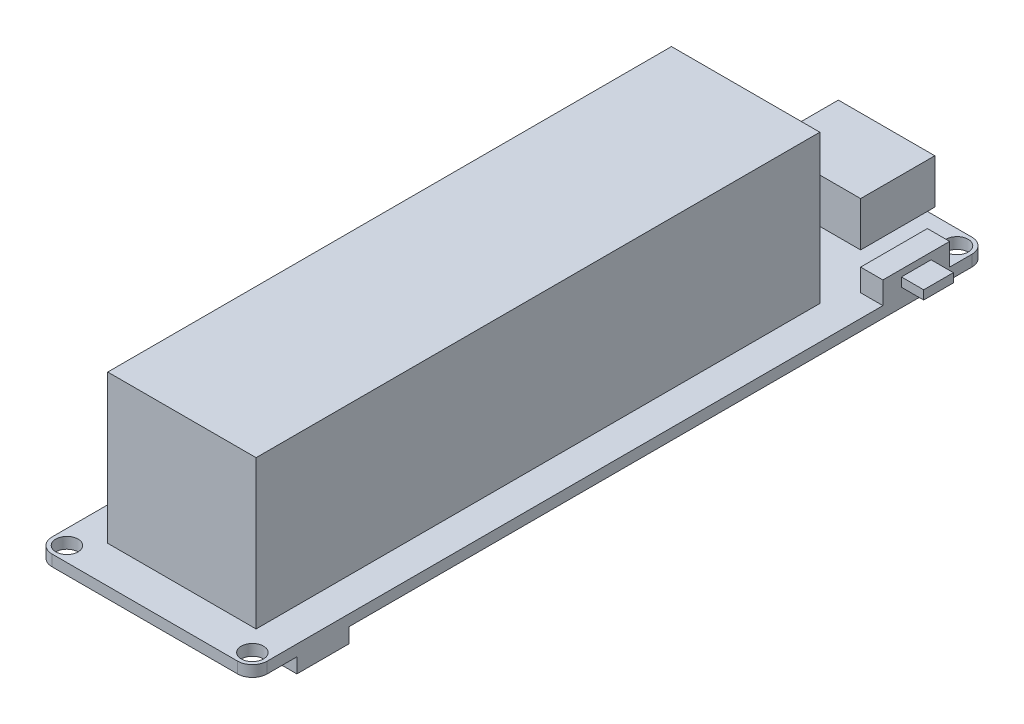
ISO-10303-21;
HEADER;
FILE_DESCRIPTION(('STEP AP214'),'2;1');
FILE_NAME('part.step','',(''),(''),'','','');
FILE_SCHEMA(('AUTOMOTIVE_DESIGN { 1 0 10303 214 1 1 1 1 }'));
ENDSEC;
DATA;
#1=APPLICATION_CONTEXT('core data for automotive mechanical design processes');
#2=APPLICATION_PROTOCOL_DEFINITION('international standard','automotive_design',2000,#1);
#3=PRODUCT_CONTEXT('',#1,'mechanical');
#4=PRODUCT('Part','Part','',(#3));
#5=PRODUCT_RELATED_PRODUCT_CATEGORY('part','',(#4));
#6=PRODUCT_DEFINITION_FORMATION('','',#4);
#7=PRODUCT_DEFINITION_CONTEXT('part definition',#1,'design');
#8=PRODUCT_DEFINITION('design','',#6,#7);
#9=PRODUCT_DEFINITION_SHAPE('','',#8);
#10=(LENGTH_UNIT() NAMED_UNIT(*) SI_UNIT(.MILLI.,.METRE.));
#11=(NAMED_UNIT(*) PLANE_ANGLE_UNIT() SI_UNIT($,.RADIAN.));
#12=(NAMED_UNIT(*) SI_UNIT($,.STERADIAN.) SOLID_ANGLE_UNIT());
#13=UNCERTAINTY_MEASURE_WITH_UNIT(LENGTH_MEASURE(1.E-05),#10,'distance_accuracy_value','');
#14=(GEOMETRIC_REPRESENTATION_CONTEXT(3) GLOBAL_UNCERTAINTY_ASSIGNED_CONTEXT((#13)) GLOBAL_UNIT_ASSIGNED_CONTEXT((#10,
#11,#12)) REPRESENTATION_CONTEXT('',''));
#15=CARTESIAN_POINT('',(0.,0.,0.));
#16=DIRECTION('',(0.,0.,1.));
#17=DIRECTION('',(1.,0.,0.));
#18=AXIS2_PLACEMENT_3D('',#15,#16,#17);
#19=CARTESIAN_POINT('',(12.5,0.,-47.5));
#20=DIRECTION('',(0.,1.,0.));
#21=DIRECTION('',(0.,0.,1.));
#22=AXIS2_PLACEMENT_3D('',#19,#20,#21);
#23=PLANE('',#22);
#24=DIRECTION('',(0.,0.,-1.));
#25=VECTOR('',#24,1.);
#26=CARTESIAN_POINT('',(-9.50000000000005,0.,0.));
#27=LINE('',#26,#25);
#28=CARTESIAN_POINT('',(-9.50000000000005,0.,-13.6));
#29=VERTEX_POINT('',#28);
#30=CARTESIAN_POINT('',(-9.50000000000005,0.,-14.5));
#31=VERTEX_POINT('',#30);
#32=EDGE_CURVE('E527',#29,#31,#27,.T.);
#33=ORIENTED_EDGE('',*,*,#32,.F.);
#34=DIRECTION('',(1.,0.,0.));
#35=VECTOR('',#34,1.);
#36=CARTESIAN_POINT('',(0.,0.,-13.6));
#37=LINE('',#36,#35);
#38=CARTESIAN_POINT('',(-8.40000000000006,0.,-13.6));
#39=VERTEX_POINT('',#38);
#40=EDGE_CURVE('E532',#29,#39,#37,.T.);
#41=ORIENTED_EDGE('',*,*,#40,.T.);
#42=DIRECTION('',(0.,0.,-1.));
#43=VECTOR('',#42,1.);
#44=CARTESIAN_POINT('',(-8.40000000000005,0.,0.));
#45=LINE('',#44,#43);
#46=CARTESIAN_POINT('',(-8.40000000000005,0.,-14.5));
#47=VERTEX_POINT('',#46);
#48=EDGE_CURVE('E546',#39,#47,#45,.T.);
#49=ORIENTED_EDGE('',*,*,#48,.T.);
#50=DIRECTION('',(1.,0.,0.));
#51=VECTOR('',#50,1.);
#52=CARTESIAN_POINT('',(0.,0.,-14.5));
#53=LINE('',#52,#51);
#54=EDGE_CURVE('E543',#31,#47,#53,.T.);
#55=ORIENTED_EDGE('',*,*,#54,.F.);
#56=EDGE_LOOP('',(#33,#41,#49,#55));
#57=FACE_BOUND('',#56,.T.);
#58=DIRECTION('',(0.,0.,-1.));
#59=VECTOR('',#58,1.);
#60=CARTESIAN_POINT('',(-9.50000000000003,0.,0.));
#61=LINE('',#60,#59);
#62=CARTESIAN_POINT('',(-9.50000000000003,0.,-21.6));
#63=VERTEX_POINT('',#62);
#64=CARTESIAN_POINT('',(-9.50000000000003,0.,-22.5));
#65=VERTEX_POINT('',#64);
#66=EDGE_CURVE('E591',#63,#65,#61,.T.);
#67=ORIENTED_EDGE('',*,*,#66,.F.);
#68=DIRECTION('',(1.,0.,0.));
#69=VECTOR('',#68,1.);
#70=CARTESIAN_POINT('',(0.,0.,-21.6));
#71=LINE('',#70,#69);
#72=CARTESIAN_POINT('',(-8.40000000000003,0.,-21.6));
#73=VERTEX_POINT('',#72);
#74=EDGE_CURVE('E596',#63,#73,#71,.T.);
#75=ORIENTED_EDGE('',*,*,#74,.T.);
#76=DIRECTION('',(0.,0.,-1.));
#77=VECTOR('',#76,1.);
#78=CARTESIAN_POINT('',(-8.40000000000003,0.,0.));
#79=LINE('',#78,#77);
#80=CARTESIAN_POINT('',(-8.40000000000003,0.,-22.5));
#81=VERTEX_POINT('',#80);
#82=EDGE_CURVE('E610',#73,#81,#79,.T.);
#83=ORIENTED_EDGE('',*,*,#82,.T.);
#84=DIRECTION('',(1.,0.,0.));
#85=VECTOR('',#84,1.);
#86=CARTESIAN_POINT('',(0.,0.,-22.5));
#87=LINE('',#86,#85);
#88=EDGE_CURVE('E607',#65,#81,#87,.T.);
#89=ORIENTED_EDGE('',*,*,#88,.F.);
#90=EDGE_LOOP('',(#67,#75,#83,#89));
#91=FACE_BOUND('',#90,.T.);
#92=CARTESIAN_POINT('',(12.5,0.,47.5));
#93=DIRECTION('',(0.,1.,0.));
#94=DIRECTION('',(0.,0.,1.));
#95=AXIS2_PLACEMENT_3D('',#92,#93,#94);
#96=CIRCLE('',#95,1.5);
#97=CARTESIAN_POINT('',(12.5,0.,49.));
#98=VERTEX_POINT('',#97);
#99=EDGE_CURVE('E879',#98,#98,#96,.T.);
#100=ORIENTED_EDGE('',*,*,#99,.T.);
#101=EDGE_LOOP('',(#100));
#102=FACE_BOUND('',#101,.T.);
#103=CARTESIAN_POINT('',(-12.5,0.,47.5));
#104=DIRECTION('',(0.,1.,0.));
#105=DIRECTION('',(0.,0.,1.));
#106=AXIS2_PLACEMENT_3D('',#103,#104,#105);
#107=CIRCLE('',#106,1.5);
#108=CARTESIAN_POINT('',(-12.5,0.,49.));
#109=VERTEX_POINT('',#108);
#110=EDGE_CURVE('E883',#109,#109,#107,.T.);
#111=ORIENTED_EDGE('',*,*,#110,.T.);
#112=EDGE_LOOP('',(#111));
#113=FACE_BOUND('',#112,.T.);
#114=CARTESIAN_POINT('',(12.5,0.,-47.5));
#115=DIRECTION('',(0.,1.,0.));
#116=DIRECTION('',(0.,0.,1.));
#117=AXIS2_PLACEMENT_3D('',#114,#115,#116);
#118=CIRCLE('',#117,1.5);
#119=CARTESIAN_POINT('',(12.5,0.,-46.));
#120=VERTEX_POINT('',#119);
#121=EDGE_CURVE('E889',#120,#120,#118,.T.);
#122=ORIENTED_EDGE('',*,*,#121,.T.);
#123=EDGE_LOOP('',(#122));
#124=FACE_BOUND('',#123,.T.);
#125=CARTESIAN_POINT('',(-12.5,0.,-47.5));
#126=DIRECTION('',(0.,1.,0.));
#127=DIRECTION('',(0.,0.,1.));
#128=AXIS2_PLACEMENT_3D('',#125,#126,#127);
#129=CIRCLE('',#128,1.5);
#130=CARTESIAN_POINT('',(-12.5,0.,-46.));
#131=VERTEX_POINT('',#130);
#132=EDGE_CURVE('E895',#131,#131,#129,.T.);
#133=ORIENTED_EDGE('',*,*,#132,.T.);
#134=EDGE_LOOP('',(#133));
#135=FACE_BOUND('',#134,.T.);
#136=DIRECTION('',(1.,0.,0.));
#137=VECTOR('',#136,1.);
#138=CARTESIAN_POINT('',(0.,0.,-29.6));
#139=LINE('',#138,#137);
#140=CARTESIAN_POINT('',(-9.5,0.,-29.6));
#141=VERTEX_POINT('',#140);
#142=CARTESIAN_POINT('',(-8.4,0.,-29.6));
#143=VERTEX_POINT('',#142);
#144=EDGE_CURVE('E669',#141,#143,#139,.T.);
#145=ORIENTED_EDGE('',*,*,#144,.T.);
#146=DIRECTION('',(0.,0.,-1.));
#147=VECTOR('',#146,1.);
#148=CARTESIAN_POINT('',(-8.4,0.,0.));
#149=LINE('',#148,#147);
#150=CARTESIAN_POINT('',(-8.4,0.,-30.5));
#151=VERTEX_POINT('',#150);
#152=EDGE_CURVE('E655',#143,#151,#149,.T.);
#153=ORIENTED_EDGE('',*,*,#152,.T.);
#154=DIRECTION('',(1.,0.,0.));
#155=VECTOR('',#154,1.);
#156=CARTESIAN_POINT('',(0.,0.,-30.5));
#157=LINE('',#156,#155);
#158=CARTESIAN_POINT('',(-9.5,0.,-30.5));
#159=VERTEX_POINT('',#158);
#160=EDGE_CURVE('E660',#159,#151,#157,.T.);
#161=ORIENTED_EDGE('',*,*,#160,.F.);
#162=DIRECTION('',(0.,0.,-1.));
#163=VECTOR('',#162,1.);
#164=CARTESIAN_POINT('',(-9.5,0.,0.));
#165=LINE('',#164,#163);
#166=EDGE_CURVE('E671',#141,#159,#165,.T.);
#167=ORIENTED_EDGE('',*,*,#166,.F.);
#168=EDGE_LOOP('',(#145,#153,#161,#167));
#169=FACE_BOUND('',#168,.T.);
#170=DIRECTION('',(0.,0.,-1.));
#171=VECTOR('',#170,1.);
#172=CARTESIAN_POINT('',(-9.50000000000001,0.,0.));
#173=LINE('',#172,#171);
#174=CARTESIAN_POINT('',(-9.50000000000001,0.,-25.6));
#175=VERTEX_POINT('',#174);
#176=CARTESIAN_POINT('',(-9.50000000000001,0.,-26.5));
#177=VERTEX_POINT('',#176);
#178=EDGE_CURVE('E623',#175,#177,#173,.T.);
#179=ORIENTED_EDGE('',*,*,#178,.F.);
#180=DIRECTION('',(1.,0.,0.));
#181=VECTOR('',#180,1.);
#182=CARTESIAN_POINT('',(0.,0.,-25.6));
#183=LINE('',#182,#181);
#184=CARTESIAN_POINT('',(-8.40000000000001,0.,-25.6));
#185=VERTEX_POINT('',#184);
#186=EDGE_CURVE('E628',#175,#185,#183,.T.);
#187=ORIENTED_EDGE('',*,*,#186,.T.);
#188=DIRECTION('',(0.,0.,-1.));
#189=VECTOR('',#188,1.);
#190=CARTESIAN_POINT('',(-8.40000000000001,0.,0.));
#191=LINE('',#190,#189);
#192=CARTESIAN_POINT('',(-8.40000000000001,0.,-26.5));
#193=VERTEX_POINT('',#192);
#194=EDGE_CURVE('E642',#185,#193,#191,.T.);
#195=ORIENTED_EDGE('',*,*,#194,.T.);
#196=DIRECTION('',(1.,0.,0.));
#197=VECTOR('',#196,1.);
#198=CARTESIAN_POINT('',(0.,0.,-26.5));
#199=LINE('',#198,#197);
#200=EDGE_CURVE('E639',#177,#193,#199,.T.);
#201=ORIENTED_EDGE('',*,*,#200,.F.);
#202=EDGE_LOOP('',(#179,#187,#195,#201));
#203=FACE_BOUND('',#202,.T.);
#204=DIRECTION('',(0.,0.,-1.));
#205=VECTOR('',#204,1.);
#206=CARTESIAN_POINT('',(-9.50000000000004,0.,0.));
#207=LINE('',#206,#205);
#208=CARTESIAN_POINT('',(-9.50000000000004,0.,-17.6));
#209=VERTEX_POINT('',#208);
#210=CARTESIAN_POINT('',(-9.50000000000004,0.,-18.5));
#211=VERTEX_POINT('',#210);
#212=EDGE_CURVE('E559',#209,#211,#207,.T.);
#213=ORIENTED_EDGE('',*,*,#212,.F.);
#214=DIRECTION('',(1.,0.,0.));
#215=VECTOR('',#214,1.);
#216=CARTESIAN_POINT('',(0.,0.,-17.6));
#217=LINE('',#216,#215);
#218=CARTESIAN_POINT('',(-8.40000000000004,0.,-17.6));
#219=VERTEX_POINT('',#218);
#220=EDGE_CURVE('E564',#209,#219,#217,.T.);
#221=ORIENTED_EDGE('',*,*,#220,.T.);
#222=DIRECTION('',(0.,0.,-1.));
#223=VECTOR('',#222,1.);
#224=CARTESIAN_POINT('',(-8.40000000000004,0.,0.));
#225=LINE('',#224,#223);
#226=CARTESIAN_POINT('',(-8.40000000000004,0.,-18.5));
#227=VERTEX_POINT('',#226);
#228=EDGE_CURVE('E578',#219,#227,#225,.T.);
#229=ORIENTED_EDGE('',*,*,#228,.T.);
#230=DIRECTION('',(1.,0.,0.));
#231=VECTOR('',#230,1.);
#232=CARTESIAN_POINT('',(0.,0.,-18.5));
#233=LINE('',#232,#231);
#234=EDGE_CURVE('E575',#211,#227,#233,.T.);
#235=ORIENTED_EDGE('',*,*,#234,.F.);
#236=EDGE_LOOP('',(#213,#221,#229,#235));
#237=FACE_BOUND('',#236,.T.);
#238=DIRECTION('',(1.,0.,0.));
#239=VECTOR('',#238,1.);
#240=CARTESIAN_POINT('',(0.,0.,-1.49999999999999));
#241=LINE('',#240,#239);
#242=CARTESIAN_POINT('',(-3.,0.,-1.49999999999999));
#243=VERTEX_POINT('',#242);
#244=CARTESIAN_POINT('',(3.5,0.,-1.5));
#245=VERTEX_POINT('',#244);
#246=EDGE_CURVE('E509',#243,#245,#241,.T.);
#247=ORIENTED_EDGE('',*,*,#246,.T.);
#248=DIRECTION('',(0.,0.,-1.));
#249=VECTOR('',#248,1.);
#250=CARTESIAN_POINT('',(3.5,0.,0.));
#251=LINE('',#250,#249);
#252=CARTESIAN_POINT('',(3.5,0.,-7.99999999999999));
#253=VERTEX_POINT('',#252);
#254=EDGE_CURVE('E495',#245,#253,#251,.T.);
#255=ORIENTED_EDGE('',*,*,#254,.T.);
#256=DIRECTION('',(1.,0.,0.));
#257=VECTOR('',#256,1.);
#258=CARTESIAN_POINT('',(0.,0.,-7.99999999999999));
#259=LINE('',#258,#257);
#260=CARTESIAN_POINT('',(-3.,0.,-7.99999999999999));
#261=VERTEX_POINT('',#260);
#262=EDGE_CURVE('E500',#261,#253,#259,.T.);
#263=ORIENTED_EDGE('',*,*,#262,.F.);
#264=DIRECTION('',(0.,0.,-1.));
#265=VECTOR('',#264,1.);
#266=CARTESIAN_POINT('',(-3.,0.,0.));
#267=LINE('',#266,#265);
#268=EDGE_CURVE('E511',#243,#261,#267,.T.);
#269=ORIENTED_EDGE('',*,*,#268,.F.);
#270=EDGE_LOOP('',(#247,#255,#263,#269));
#271=FACE_BOUND('',#270,.T.);
#272=DIRECTION('',(-1.,0.,0.));
#273=VECTOR('',#272,1.);
#274=CARTESIAN_POINT('',(0.,0.,43.5));
#275=LINE('',#274,#273);
#276=CARTESIAN_POINT('',(14.5,0.,43.5));
#277=VERTEX_POINT('',#276);
#278=CARTESIAN_POINT('',(9.5,0.,43.5));
#279=VERTEX_POINT('',#278);
#280=EDGE_CURVE('E463',#277,#279,#275,.T.);
#281=ORIENTED_EDGE('',*,*,#280,.F.);
#282=DIRECTION('',(0.,0.,-1.));
#283=VECTOR('',#282,1.);
#284=CARTESIAN_POINT('',(14.5,0.,47.5));
#285=LINE('',#284,#283);
#286=CARTESIAN_POINT('',(14.5,0.,47.5));
#287=VERTEX_POINT('',#286);
#288=EDGE_CURVE('E908',#287,#277,#285,.T.);
#289=ORIENTED_EDGE('',*,*,#288,.F.);
#290=CARTESIAN_POINT('',(12.5,0.,47.5));
#291=DIRECTION('',(0.,1.,0.));
#292=DIRECTION('',(0.,0.,-1.));
#293=AXIS2_PLACEMENT_3D('',#290,#291,#292);
#294=CIRCLE('',#293,2.);
#295=CARTESIAN_POINT('',(12.5,0.,49.5));
#296=VERTEX_POINT('',#295);
#297=EDGE_CURVE('E942',#296,#287,#294,.T.);
#298=ORIENTED_EDGE('',*,*,#297,.F.);
#299=DIRECTION('',(1.,0.,0.));
#300=VECTOR('',#299,1.);
#301=CARTESIAN_POINT('',(12.5,0.,49.5));
#302=LINE('',#301,#300);
#303=CARTESIAN_POINT('',(-12.5,0.,49.5));
#304=VERTEX_POINT('',#303);
#305=EDGE_CURVE('E940',#304,#296,#302,.T.);
#306=ORIENTED_EDGE('',*,*,#305,.F.);
#307=CARTESIAN_POINT('',(-12.5,0.,47.5));
#308=DIRECTION('',(0.,1.,0.));
#309=DIRECTION('',(0.,0.,-1.));
#310=AXIS2_PLACEMENT_3D('',#307,#308,#309);
#311=CIRCLE('',#310,2.);
#312=CARTESIAN_POINT('',(-14.5,0.,47.5));
#313=VERTEX_POINT('',#312);
#314=EDGE_CURVE('E938',#313,#304,#311,.T.);
#315=ORIENTED_EDGE('',*,*,#314,.F.);
#316=DIRECTION('',(0.,0.,1.));
#317=VECTOR('',#316,1.);
#318=CARTESIAN_POINT('',(-14.5,0.,47.5));
#319=LINE('',#318,#317);
#320=CARTESIAN_POINT('',(-14.5,0.,31.));
#321=VERTEX_POINT('',#320);
#322=EDGE_CURVE('E934',#321,#313,#319,.T.);
#323=ORIENTED_EDGE('',*,*,#322,.F.);
#324=DIRECTION('',(1.,0.,0.));
#325=VECTOR('',#324,1.);
#326=CARTESIAN_POINT('',(0.,0.,31.));
#327=LINE('',#326,#325);
#328=CARTESIAN_POINT('',(-8.5,0.,31.));
#329=VERTEX_POINT('',#328);
#330=EDGE_CURVE('E57',#321,#329,#327,.T.);
#331=ORIENTED_EDGE('',*,*,#330,.T.);
#332=DIRECTION('',(0.,0.,-1.));
#333=VECTOR('',#332,1.);
#334=CARTESIAN_POINT('',(-8.5,0.,0.));
#335=LINE('',#334,#333);
#336=CARTESIAN_POINT('',(-8.5,0.,22.));
#337=VERTEX_POINT('',#336);
#338=EDGE_CURVE('E465',#329,#337,#335,.T.);
#339=ORIENTED_EDGE('',*,*,#338,.T.);
#340=DIRECTION('',(1.,0.,0.));
#341=VECTOR('',#340,1.);
#342=CARTESIAN_POINT('',(0.,0.,22.));
#343=LINE('',#342,#341);
#344=CARTESIAN_POINT('',(-14.5,0.,22.));
#345=VERTEX_POINT('',#344);
#346=EDGE_CURVE('E477',#345,#337,#343,.T.);
#347=ORIENTED_EDGE('',*,*,#346,.F.);
#348=CARTESIAN_POINT('',(-14.5,0.,-47.5));
#349=VERTEX_POINT('',#348);
#350=EDGE_CURVE('E935',#349,#345,#319,.T.);
#351=ORIENTED_EDGE('',*,*,#350,.F.);
#352=CARTESIAN_POINT('',(-12.5,0.,-47.5));
#353=DIRECTION('',(0.,1.,0.));
#354=DIRECTION('',(0.,0.,-1.));
#355=AXIS2_PLACEMENT_3D('',#352,#353,#354);
#356=CIRCLE('',#355,2.);
#357=CARTESIAN_POINT('',(-12.5,0.,-49.5));
#358=VERTEX_POINT('',#357);
#359=EDGE_CURVE('E932',#358,#349,#356,.T.);
#360=ORIENTED_EDGE('',*,*,#359,.F.);
#361=DIRECTION('',(-1.,0.,0.));
#362=VECTOR('',#361,1.);
#363=CARTESIAN_POINT('',(12.5,0.,-49.5));
#364=LINE('',#363,#362);
#365=CARTESIAN_POINT('',(12.5,0.,-49.5));
#366=VERTEX_POINT('',#365);
#367=EDGE_CURVE('E930',#366,#358,#364,.T.);
#368=ORIENTED_EDGE('',*,*,#367,.F.);
#369=CARTESIAN_POINT('',(12.5,0.,-47.5));
#370=DIRECTION('',(0.,1.,0.));
#371=DIRECTION('',(0.,0.,1.));
#372=AXIS2_PLACEMENT_3D('',#369,#370,#371);
#373=CIRCLE('',#372,2.);
#374=CARTESIAN_POINT('',(14.5,0.,-47.5));
#375=VERTEX_POINT('',#374);
#376=EDGE_CURVE('E901',#375,#366,#373,.T.);
#377=ORIENTED_EDGE('',*,*,#376,.F.);
#378=CARTESIAN_POINT('',(14.5,0.,36.5));
#379=VERTEX_POINT('',#378);
#380=EDGE_CURVE('E944',#379,#375,#285,.T.);
#381=ORIENTED_EDGE('',*,*,#380,.F.);
#382=DIRECTION('',(-1.,0.,0.));
#383=VECTOR('',#382,1.);
#384=CARTESIAN_POINT('',(0.,0.,36.5));
#385=LINE('',#384,#383);
#386=CARTESIAN_POINT('',(9.5,0.,36.5));
#387=VERTEX_POINT('',#386);
#388=EDGE_CURVE('E49',#379,#387,#385,.T.);
#389=ORIENTED_EDGE('',*,*,#388,.T.);
#390=DIRECTION('',(0.,0.,-1.));
#391=VECTOR('',#390,1.);
#392=CARTESIAN_POINT('',(9.5,0.,0.));
#393=LINE('',#392,#391);
#394=EDGE_CURVE('E1016',#279,#387,#393,.T.);
#395=ORIENTED_EDGE('',*,*,#394,.F.);
#396=EDGE_LOOP('',(#281,#289,#298,#306,#315,#323,#331,#339,#347,#351,#360,#368,#377,#381,#389,#395));
#397=FACE_BOUND('',#396,.T.);
#398=ADVANCED_FACE('F34',(#57,#91,#102,#113,#124,#135,#169,#203,#237,#271,#397),#23,.F.);
#399=CARTESIAN_POINT('',(14.5,1.5,47.5));
#400=DIRECTION('',(-1.,0.,0.));
#401=DIRECTION('',(0.,0.,1.));
#402=AXIS2_PLACEMENT_3D('',#399,#400,#401);
#403=PLANE('',#402);
#404=ORIENTED_EDGE('',*,*,#288,.T.);
#405=DIRECTION('',(0.,1.,0.));
#406=VECTOR('',#405,1.);
#407=CARTESIAN_POINT('',(14.5,-2.,43.5));
#408=LINE('',#407,#406);
#409=CARTESIAN_POINT('',(14.5,-2.,43.5));
#410=VERTEX_POINT('',#409);
#411=EDGE_CURVE('E1012',#410,#277,#408,.T.);
#412=ORIENTED_EDGE('',*,*,#411,.F.);
#413=DIRECTION('',(0.,0.,1.));
#414=VECTOR('',#413,1.);
#415=CARTESIAN_POINT('',(14.5,-2.,0.));
#416=LINE('',#415,#414);
#417=CARTESIAN_POINT('',(14.5,-2.,36.5));
#418=VERTEX_POINT('',#417);
#419=EDGE_CURVE('E457',#418,#410,#416,.T.);
#420=ORIENTED_EDGE('',*,*,#419,.F.);
#421=DIRECTION('',(0.,1.,0.));
#422=VECTOR('',#421,1.);
#423=CARTESIAN_POINT('',(14.5,-2.,36.5));
#424=LINE('',#423,#422);
#425=EDGE_CURVE('E469',#418,#379,#424,.T.);
#426=ORIENTED_EDGE('',*,*,#425,.T.);
#427=ORIENTED_EDGE('',*,*,#380,.T.);
#428=DIRECTION('',(0.,-1.,0.));
#429=VECTOR('',#428,1.);
#430=CARTESIAN_POINT('',(14.5,1.5,-47.5));
#431=LINE('',#430,#429);
#432=CARTESIAN_POINT('',(14.5,1.5,-47.5));
#433=VERTEX_POINT('',#432);
#434=EDGE_CURVE('E927',#433,#375,#431,.T.);
#435=ORIENTED_EDGE('',*,*,#434,.F.);
#436=DIRECTION('',(0.,0.,-1.));
#437=VECTOR('',#436,1.);
#438=CARTESIAN_POINT('',(14.5,1.5,47.5));
#439=LINE('',#438,#437);
#440=CARTESIAN_POINT('',(14.5,1.5,-44.5));
#441=VERTEX_POINT('',#440);
#442=EDGE_CURVE('E924',#441,#433,#439,.T.);
#443=ORIENTED_EDGE('',*,*,#442,.F.);
#444=DIRECTION('',(0.,-1.,0.));
#445=VECTOR('',#444,1.);
#446=CARTESIAN_POINT('',(14.5,4.5,-44.5));
#447=LINE('',#446,#445);
#448=CARTESIAN_POINT('',(14.5,4.5,-44.5));
#449=VERTEX_POINT('',#448);
#450=EDGE_CURVE('E765',#449,#441,#447,.T.);
#451=ORIENTED_EDGE('',*,*,#450,.F.);
#452=DIRECTION('',(0.,0.,-1.));
#453=VECTOR('',#452,1.);
#454=CARTESIAN_POINT('',(14.5,4.5,0.));
#455=LINE('',#454,#453);
#456=CARTESIAN_POINT('',(14.5,4.5,-35.5));
#457=VERTEX_POINT('',#456);
#458=EDGE_CURVE('E763',#457,#449,#455,.T.);
#459=ORIENTED_EDGE('',*,*,#458,.F.);
#460=DIRECTION('',(0.,-1.,0.));
#461=VECTOR('',#460,1.);
#462=CARTESIAN_POINT('',(14.5,4.5,-35.5));
#463=LINE('',#462,#461);
#464=CARTESIAN_POINT('',(14.5,1.5,-35.5));
#465=VERTEX_POINT('',#464);
#466=EDGE_CURVE('E774',#457,#465,#463,.T.);
#467=ORIENTED_EDGE('',*,*,#466,.T.);
#468=CARTESIAN_POINT('',(14.5,1.5,47.5));
#469=VERTEX_POINT('',#468);
#470=EDGE_CURVE('E925',#469,#465,#439,.T.);
#471=ORIENTED_EDGE('',*,*,#470,.F.);
#472=DIRECTION('',(0.,-1.,0.));
#473=VECTOR('',#472,1.);
#474=CARTESIAN_POINT('',(14.5,1.5,47.5));
#475=LINE('',#474,#473);
#476=EDGE_CURVE('E949',#469,#287,#475,.T.);
#477=ORIENTED_EDGE('',*,*,#476,.T.);
#478=EDGE_LOOP('',(#404,#412,#420,#426,#427,#435,#443,#451,#459,#467,#471,#477));
#479=FACE_BOUND('',#478,.T.);
#480=DIRECTION('',(0.,1.,0.));
#481=VECTOR('',#480,1.);
#482=CARTESIAN_POINT('',(14.5,2.4,-42.));
#483=LINE('',#482,#481);
#484=CARTESIAN_POINT('',(14.5,2.4,-42.));
#485=VERTEX_POINT('',#484);
#486=CARTESIAN_POINT('',(14.5,3.6,-42.));
#487=VERTEX_POINT('',#486);
#488=EDGE_CURVE('E687',#485,#487,#483,.T.);
#489=ORIENTED_EDGE('',*,*,#488,.F.);
#490=DIRECTION('',(0.,0.,-1.));
#491=VECTOR('',#490,1.);
#492=CARTESIAN_POINT('',(14.5,2.4,-38.));
#493=LINE('',#492,#491);
#494=CARTESIAN_POINT('',(14.5,2.4,-38.));
#495=VERTEX_POINT('',#494);
#496=EDGE_CURVE('E692',#495,#485,#493,.T.);
#497=ORIENTED_EDGE('',*,*,#496,.F.);
#498=DIRECTION('',(0.,-1.,0.));
#499=VECTOR('',#498,1.);
#500=CARTESIAN_POINT('',(14.5,2.4,-38.));
#501=LINE('',#500,#499);
#502=CARTESIAN_POINT('',(14.5,3.6,-38.));
#503=VERTEX_POINT('',#502);
#504=EDGE_CURVE('E704',#503,#495,#501,.T.);
#505=ORIENTED_EDGE('',*,*,#504,.F.);
#506=DIRECTION('',(0.,0.,1.));
#507=VECTOR('',#506,1.);
#508=CARTESIAN_POINT('',(14.5,3.6,-38.));
#509=LINE('',#508,#507);
#510=EDGE_CURVE('E701',#487,#503,#509,.T.);
#511=ORIENTED_EDGE('',*,*,#510,.F.);
#512=EDGE_LOOP('',(#489,#497,#505,#511));
#513=FACE_BOUND('',#512,.T.);
#514=ADVANCED_FACE('F1010',(#479,#513),#403,.F.);
#515=CARTESIAN_POINT('',(-14.5,1.5,47.5));
#516=DIRECTION('',(1.,0.,0.));
#517=DIRECTION('',(0.,0.,-1.));
#518=AXIS2_PLACEMENT_3D('',#515,#516,#517);
#519=PLANE('',#518);
#520=ORIENTED_EDGE('',*,*,#350,.T.);
#521=DIRECTION('',(0.,1.,0.));
#522=VECTOR('',#521,1.);
#523=CARTESIAN_POINT('',(-14.5,-3.,22.));
#524=LINE('',#523,#522);
#525=CARTESIAN_POINT('',(-14.5,-3.,22.));
#526=VERTEX_POINT('',#525);
#527=EDGE_CURVE('E489',#526,#345,#524,.T.);
#528=ORIENTED_EDGE('',*,*,#527,.F.);
#529=DIRECTION('',(0.,0.,-1.));
#530=VECTOR('',#529,1.);
#531=CARTESIAN_POINT('',(-14.5,-3.,0.));
#532=LINE('',#531,#530);
#533=CARTESIAN_POINT('',(-14.5,-3.,31.));
#534=VERTEX_POINT('',#533);
#535=EDGE_CURVE('E480',#534,#526,#532,.T.);
#536=ORIENTED_EDGE('',*,*,#535,.F.);
#537=DIRECTION('',(0.,1.,0.));
#538=VECTOR('',#537,1.);
#539=CARTESIAN_POINT('',(-14.5,-3.,31.));
#540=LINE('',#539,#538);
#541=EDGE_CURVE('E491',#534,#321,#540,.T.);
#542=ORIENTED_EDGE('',*,*,#541,.T.);
#543=ORIENTED_EDGE('',*,*,#322,.T.);
#544=DIRECTION('',(0.,-1.,0.));
#545=VECTOR('',#544,1.);
#546=CARTESIAN_POINT('',(-14.5,1.5,47.5));
#547=LINE('',#546,#545);
#548=CARTESIAN_POINT('',(-14.5,1.5,47.5));
#549=VERTEX_POINT('',#548);
#550=EDGE_CURVE('E958',#549,#313,#547,.T.);
#551=ORIENTED_EDGE('',*,*,#550,.F.);
#552=DIRECTION('',(0.,0.,1.));
#553=VECTOR('',#552,1.);
#554=CARTESIAN_POINT('',(-14.5,1.5,47.5));
#555=LINE('',#554,#553);
#556=CARTESIAN_POINT('',(-14.5,1.5,-33.5));
#557=VERTEX_POINT('',#556);
#558=EDGE_CURVE('E915',#557,#549,#555,.T.);
#559=ORIENTED_EDGE('',*,*,#558,.F.);
#560=DIRECTION('',(0.,-1.,0.));
#561=VECTOR('',#560,1.);
#562=CARTESIAN_POINT('',(-14.5,5.5,-33.5));
#563=LINE('',#562,#561);
#564=CARTESIAN_POINT('',(-14.5,5.5,-33.5));
#565=VERTEX_POINT('',#564);
#566=EDGE_CURVE('E795',#565,#557,#563,.T.);
#567=ORIENTED_EDGE('',*,*,#566,.F.);
#568=DIRECTION('',(0.,0.,1.));
#569=VECTOR('',#568,1.);
#570=CARTESIAN_POINT('',(-14.5,5.5,0.));
#571=LINE('',#570,#569);
#572=CARTESIAN_POINT('',(-14.5,5.5,-40.5));
#573=VERTEX_POINT('',#572);
#574=EDGE_CURVE('E793',#573,#565,#571,.T.);
#575=ORIENTED_EDGE('',*,*,#574,.F.);
#576=DIRECTION('',(0.,-1.,0.));
#577=VECTOR('',#576,1.);
#578=CARTESIAN_POINT('',(-14.5,5.5,-40.5));
#579=LINE('',#578,#577);
#580=CARTESIAN_POINT('',(-14.5,1.5,-40.5));
#581=VERTEX_POINT('',#580);
#582=EDGE_CURVE('E804',#573,#581,#579,.T.);
#583=ORIENTED_EDGE('',*,*,#582,.T.);
#584=CARTESIAN_POINT('',(-14.5,1.5,-47.5));
#585=VERTEX_POINT('',#584);
#586=EDGE_CURVE('E916',#585,#581,#555,.T.);
#587=ORIENTED_EDGE('',*,*,#586,.F.);
#588=DIRECTION('',(0.,-1.,0.));
#589=VECTOR('',#588,1.);
#590=CARTESIAN_POINT('',(-14.5,1.5,-47.5));
#591=LINE('',#590,#589);
#592=EDGE_CURVE('E961',#585,#349,#591,.T.);
#593=ORIENTED_EDGE('',*,*,#592,.T.);
#594=EDGE_LOOP('',(#520,#528,#536,#542,#543,#551,#559,#567,#575,#583,#587,#593));
#595=FACE_BOUND('',#594,.T.);
#596=DIRECTION('',(0.,1.,0.));
#597=VECTOR('',#596,1.);
#598=CARTESIAN_POINT('',(-14.5,4.5,-35.5));
#599=LINE('',#598,#597);
#600=CARTESIAN_POINT('',(-14.5,2.5,-35.5));
#601=VERTEX_POINT('',#600);
#602=CARTESIAN_POINT('',(-14.5,4.5,-35.5));
#603=VERTEX_POINT('',#602);
#604=EDGE_CURVE('E720',#601,#603,#599,.T.);
#605=ORIENTED_EDGE('',*,*,#604,.F.);
#606=DIRECTION('',(0.,0.,1.));
#607=VECTOR('',#606,1.);
#608=CARTESIAN_POINT('',(-14.5,2.5,-38.5));
#609=LINE('',#608,#607);
#610=CARTESIAN_POINT('',(-14.5,2.5,-38.5));
#611=VERTEX_POINT('',#610);
#612=EDGE_CURVE('E725',#611,#601,#609,.T.);
#613=ORIENTED_EDGE('',*,*,#612,.F.);
#614=DIRECTION('',(0.,-1.,0.));
#615=VECTOR('',#614,1.);
#616=CARTESIAN_POINT('',(-14.5,4.5,-38.5));
#617=LINE('',#616,#615);
#618=CARTESIAN_POINT('',(-14.5,4.5,-38.5));
#619=VERTEX_POINT('',#618);
#620=EDGE_CURVE('E737',#619,#611,#617,.T.);
#621=ORIENTED_EDGE('',*,*,#620,.F.);
#622=DIRECTION('',(0.,0.,-1.));
#623=VECTOR('',#622,1.);
#624=CARTESIAN_POINT('',(-14.5,4.5,-38.5));
#625=LINE('',#624,#623);
#626=EDGE_CURVE('E734',#603,#619,#625,.T.);
#627=ORIENTED_EDGE('',*,*,#626,.F.);
#628=EDGE_LOOP('',(#605,#613,#621,#627));
#629=FACE_BOUND('',#628,.T.);
#630=ADVANCED_FACE('F977',(#595,#629),#519,.F.);
#631=CARTESIAN_POINT('',(12.5,1.5,-47.5));
#632=DIRECTION('',(0.,1.,0.));
#633=DIRECTION('',(0.,0.,1.));
#634=AXIS2_PLACEMENT_3D('',#631,#632,#633);
#635=PLANE('',#634);
#636=CARTESIAN_POINT('',(-12.5,1.5,47.5));
#637=DIRECTION('',(0.,1.,0.));
#638=DIRECTION('',(0.,0.,1.));
#639=AXIS2_PLACEMENT_3D('',#636,#637,#638);
#640=CIRCLE('',#639,1.5);
#641=CARTESIAN_POINT('',(-12.5,1.5,49.));
#642=VERTEX_POINT('',#641);
#643=EDGE_CURVE('E886',#642,#642,#640,.T.);
#644=ORIENTED_EDGE('',*,*,#643,.F.);
#645=EDGE_LOOP('',(#644));
#646=FACE_BOUND('',#645,.T.);
#647=CARTESIAN_POINT('',(-12.5,1.5,-47.5));
#648=DIRECTION('',(0.,1.,0.));
#649=DIRECTION('',(0.,0.,1.));
#650=AXIS2_PLACEMENT_3D('',#647,#648,#649);
#651=CIRCLE('',#650,1.5);
#652=CARTESIAN_POINT('',(-12.5,1.5,-46.));
#653=VERTEX_POINT('',#652);
#654=EDGE_CURVE('E898',#653,#653,#651,.T.);
#655=ORIENTED_EDGE('',*,*,#654,.F.);
#656=EDGE_LOOP('',(#655));
#657=FACE_BOUND('',#656,.T.);
#658=CARTESIAN_POINT('',(12.5,1.5,-47.5));
#659=DIRECTION('',(0.,1.,0.));
#660=DIRECTION('',(0.,0.,1.));
#661=AXIS2_PLACEMENT_3D('',#658,#659,#660);
#662=CIRCLE('',#661,1.5);
#663=CARTESIAN_POINT('',(12.5,1.5,-46.));
#664=VERTEX_POINT('',#663);
#665=EDGE_CURVE('E892',#664,#664,#662,.T.);
#666=ORIENTED_EDGE('',*,*,#665,.F.);
#667=EDGE_LOOP('',(#666));
#668=FACE_BOUND('',#667,.T.);
#669=CARTESIAN_POINT('',(12.5,1.5,47.5));
#670=DIRECTION('',(0.,1.,0.));
#671=DIRECTION('',(0.,0.,1.));
#672=AXIS2_PLACEMENT_3D('',#669,#670,#671);
#673=CIRCLE('',#672,1.5);
#674=CARTESIAN_POINT('',(12.5,1.5,49.));
#675=VERTEX_POINT('',#674);
#676=EDGE_CURVE('E880',#675,#675,#673,.T.);
#677=ORIENTED_EDGE('',*,*,#676,.F.);
#678=EDGE_LOOP('',(#677));
#679=FACE_BOUND('',#678,.T.);
#680=DIRECTION('',(1.,0.,0.));
#681=VECTOR('',#680,1.);
#682=CARTESIAN_POINT('',(-10.,1.5,44.5));
#683=LINE('',#682,#681);
#684=CARTESIAN_POINT('',(-10.,1.5,44.5));
#685=VERTEX_POINT('',#684);
#686=CARTESIAN_POINT('',(10.,1.5,44.5));
#687=VERTEX_POINT('',#686);
#688=EDGE_CURVE('E864',#685,#687,#683,.T.);
#689=ORIENTED_EDGE('',*,*,#688,.F.);
#690=DIRECTION('',(0.,0.,1.));
#691=VECTOR('',#690,1.);
#692=CARTESIAN_POINT('',(-10.,1.5,44.5));
#693=LINE('',#692,#691);
#694=CARTESIAN_POINT('',(-10.,1.5,-31.5));
#695=VERTEX_POINT('',#694);
#696=EDGE_CURVE('E850',#695,#685,#693,.T.);
#697=ORIENTED_EDGE('',*,*,#696,.F.);
#698=DIRECTION('',(-1.,0.,0.));
#699=VECTOR('',#698,1.);
#700=CARTESIAN_POINT('',(-10.,1.5,-31.5));
#701=LINE('',#700,#699);
#702=CARTESIAN_POINT('',(10.,1.5,-31.5));
#703=VERTEX_POINT('',#702);
#704=EDGE_CURVE('E855',#703,#695,#701,.T.);
#705=ORIENTED_EDGE('',*,*,#704,.F.);
#706=DIRECTION('',(0.,0.,-1.));
#707=VECTOR('',#706,1.);
#708=CARTESIAN_POINT('',(10.,1.5,44.5));
#709=LINE('',#708,#707);
#710=EDGE_CURVE('E866',#687,#703,#709,.T.);
#711=ORIENTED_EDGE('',*,*,#710,.F.);
#712=EDGE_LOOP('',(#689,#697,#705,#711));
#713=FACE_BOUND('',#712,.T.);
#714=DIRECTION('',(0.,0.,1.));
#715=VECTOR('',#714,1.);
#716=CARTESIAN_POINT('',(11.5,1.5,0.));
#717=LINE('',#716,#715);
#718=CARTESIAN_POINT('',(11.5,1.5,-44.5));
#719=VERTEX_POINT('',#718);
#720=CARTESIAN_POINT('',(11.5,1.5,-35.5));
#721=VERTEX_POINT('',#720);
#722=EDGE_CURVE('E768',#719,#721,#717,.T.);
#723=ORIENTED_EDGE('',*,*,#722,.F.);
#724=DIRECTION('',(-1.,0.,0.));
#725=VECTOR('',#724,1.);
#726=CARTESIAN_POINT('',(-1.02926926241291E-13,1.5,-44.5));
#727=LINE('',#726,#725);
#728=EDGE_CURVE('E753',#441,#719,#727,.T.);
#729=ORIENTED_EDGE('',*,*,#728,.F.);
#730=ORIENTED_EDGE('',*,*,#442,.T.);
#731=CARTESIAN_POINT('',(12.5,1.5,-47.5));
#732=DIRECTION('',(0.,1.,0.));
#733=DIRECTION('',(0.,0.,1.));
#734=AXIS2_PLACEMENT_3D('',#731,#732,#733);
#735=CIRCLE('',#734,2.);
#736=CARTESIAN_POINT('',(12.5,1.5,-49.5));
#737=VERTEX_POINT('',#736);
#738=EDGE_CURVE('E904',#433,#737,#735,.T.);
#739=ORIENTED_EDGE('',*,*,#738,.T.);
#740=DIRECTION('',(-1.,0.,0.));
#741=VECTOR('',#740,1.);
#742=CARTESIAN_POINT('',(12.5,1.5,-49.5));
#743=LINE('',#742,#741);
#744=CARTESIAN_POINT('',(6.5,1.5,-49.5));
#745=VERTEX_POINT('',#744);
#746=EDGE_CURVE('E909',#737,#745,#743,.T.);
#747=ORIENTED_EDGE('',*,*,#746,.T.);
#748=DIRECTION('',(0.,0.,-1.));
#749=VECTOR('',#748,1.);
#750=CARTESIAN_POINT('',(6.5,1.5,0.));
#751=LINE('',#750,#749);
#752=CARTESIAN_POINT('',(6.5,1.5,-40.5));
#753=VERTEX_POINT('',#752);
#754=EDGE_CURVE('E830',#753,#745,#751,.T.);
#755=ORIENTED_EDGE('',*,*,#754,.F.);
#756=DIRECTION('',(1.,0.,0.));
#757=VECTOR('',#756,1.);
#758=CARTESIAN_POINT('',(0.,1.5,-40.5));
#759=LINE('',#758,#757);
#760=CARTESIAN_POINT('',(-6.5,1.5,-40.5));
#761=VERTEX_POINT('',#760);
#762=EDGE_CURVE('E813',#761,#753,#759,.T.);
#763=ORIENTED_EDGE('',*,*,#762,.F.);
#764=DIRECTION('',(0.,0.,-1.));
#765=VECTOR('',#764,1.);
#766=CARTESIAN_POINT('',(-6.5,1.5,0.));
#767=LINE('',#766,#765);
#768=CARTESIAN_POINT('',(-6.5,1.5,-49.5));
#769=VERTEX_POINT('',#768);
#770=EDGE_CURVE('E818',#761,#769,#767,.T.);
#771=ORIENTED_EDGE('',*,*,#770,.T.);
#772=CARTESIAN_POINT('',(-12.5,1.5,-49.5));
#773=VERTEX_POINT('',#772);
#774=EDGE_CURVE('E907',#769,#773,#743,.T.);
#775=ORIENTED_EDGE('',*,*,#774,.T.);
#776=CARTESIAN_POINT('',(-12.5,1.5,-47.5));
#777=DIRECTION('',(0.,1.,0.));
#778=DIRECTION('',(0.,0.,-1.));
#779=AXIS2_PLACEMENT_3D('',#776,#777,#778);
#780=CIRCLE('',#779,2.);
#781=EDGE_CURVE('E912',#773,#585,#780,.T.);
#782=ORIENTED_EDGE('',*,*,#781,.T.);
#783=ORIENTED_EDGE('',*,*,#586,.T.);
#784=DIRECTION('',(1.,0.,0.));
#785=VECTOR('',#784,1.);
#786=CARTESIAN_POINT('',(0.,1.5,-40.5));
#787=LINE('',#786,#785);
#788=CARTESIAN_POINT('',(-9.5,1.5,-40.5));
#789=VERTEX_POINT('',#788);
#790=EDGE_CURVE('E788',#581,#789,#787,.T.);
#791=ORIENTED_EDGE('',*,*,#790,.T.);
#792=DIRECTION('',(0.,0.,-1.));
#793=VECTOR('',#792,1.);
#794=CARTESIAN_POINT('',(-9.5,1.5,0.));
#795=LINE('',#794,#793);
#796=CARTESIAN_POINT('',(-9.5,1.5,-33.5));
#797=VERTEX_POINT('',#796);
#798=EDGE_CURVE('E798',#797,#789,#795,.T.);
#799=ORIENTED_EDGE('',*,*,#798,.F.);
#800=DIRECTION('',(1.,0.,0.));
#801=VECTOR('',#800,1.);
#802=CARTESIAN_POINT('',(0.,1.5,-33.5));
#803=LINE('',#802,#801);
#804=EDGE_CURVE('E783',#557,#797,#803,.T.);
#805=ORIENTED_EDGE('',*,*,#804,.F.);
#806=ORIENTED_EDGE('',*,*,#558,.T.);
#807=CARTESIAN_POINT('',(-12.5,1.5,47.5));
#808=DIRECTION('',(0.,1.,0.));
#809=DIRECTION('',(0.,0.,-1.));
#810=AXIS2_PLACEMENT_3D('',#807,#808,#809);
#811=CIRCLE('',#810,2.);
#812=CARTESIAN_POINT('',(-12.5,1.5,49.5));
#813=VERTEX_POINT('',#812);
#814=EDGE_CURVE('E918',#549,#813,#811,.T.);
#815=ORIENTED_EDGE('',*,*,#814,.T.);
#816=DIRECTION('',(1.,0.,0.));
#817=VECTOR('',#816,1.);
#818=CARTESIAN_POINT('',(12.5,1.5,49.5));
#819=LINE('',#818,#817);
#820=CARTESIAN_POINT('',(12.5,1.5,49.5));
#821=VERTEX_POINT('',#820);
#822=EDGE_CURVE('E920',#813,#821,#819,.T.);
#823=ORIENTED_EDGE('',*,*,#822,.T.);
#824=CARTESIAN_POINT('',(12.5,1.5,47.5));
#825=DIRECTION('',(0.,1.,0.));
#826=DIRECTION('',(0.,0.,-1.));
#827=AXIS2_PLACEMENT_3D('',#824,#825,#826);
#828=CIRCLE('',#827,2.);
#829=EDGE_CURVE('E922',#821,#469,#828,.T.);
#830=ORIENTED_EDGE('',*,*,#829,.T.);
#831=ORIENTED_EDGE('',*,*,#470,.T.);
#832=DIRECTION('',(-1.,0.,0.));
#833=VECTOR('',#832,1.);
#834=CARTESIAN_POINT('',(0.,1.5,-35.5));
#835=LINE('',#834,#833);
#836=EDGE_CURVE('E758',#465,#721,#835,.T.);
#837=ORIENTED_EDGE('',*,*,#836,.T.);
#838=EDGE_LOOP('',(#723,#729,#730,#739,#747,#755,#763,#771,#775,#782,#783,#791,#799,#805,#806,
#815,#823,#830,#831,#837));
#839=FACE_BOUND('',#838,.T.);
#840=ADVANCED_FACE('F985',(#646,#657,#668,#679,#713,#839),#635,.T.);
#841=CARTESIAN_POINT('',(12.5,1.5,-47.5));
#842=DIRECTION('',(0.,-1.,0.));
#843=DIRECTION('',(0.,0.,-1.));
#844=AXIS2_PLACEMENT_3D('',#841,#842,#843);
#845=CYLINDRICAL_SURFACE('',#844,2.);
#846=ORIENTED_EDGE('',*,*,#376,.T.);
#847=DIRECTION('',(0.,-1.,0.));
#848=VECTOR('',#847,1.);
#849=CARTESIAN_POINT('',(12.5,1.5,-49.5));
#850=LINE('',#849,#848);
#851=EDGE_CURVE('E11',#737,#366,#850,.T.);
#852=ORIENTED_EDGE('',*,*,#851,.F.);
#853=ORIENTED_EDGE('',*,*,#738,.F.);
#854=ORIENTED_EDGE('',*,*,#434,.T.);
#855=EDGE_LOOP('',(#846,#852,#853,#854));
#856=FACE_BOUND('',#855,.T.);
#857=ADVANCED_FACE('F36',(#856),#845,.T.);
#858=CARTESIAN_POINT('',(12.5,1.5,-49.5));
#859=DIRECTION('',(0.,0.,1.));
#860=DIRECTION('',(1.,0.,0.));
#861=AXIS2_PLACEMENT_3D('',#858,#859,#860);
#862=PLANE('',#861);
#863=ORIENTED_EDGE('',*,*,#367,.T.);
#864=DIRECTION('',(0.,-1.,0.));
#865=VECTOR('',#864,1.);
#866=CARTESIAN_POINT('',(-12.5,1.5,-49.5));
#867=LINE('',#866,#865);
#868=EDGE_CURVE('E42',#773,#358,#867,.T.);
#869=ORIENTED_EDGE('',*,*,#868,.F.);
#870=ORIENTED_EDGE('',*,*,#774,.F.);
#871=EDGE_CURVE('E913',#745,#769,#743,.T.);
#872=ORIENTED_EDGE('',*,*,#871,.F.);
#873=ORIENTED_EDGE('',*,*,#746,.F.);
#874=ORIENTED_EDGE('',*,*,#851,.T.);
#875=EDGE_LOOP('',(#863,#869,#870,#872,#873,#874));
#876=FACE_BOUND('',#875,.T.);
#877=ADVANCED_FACE('F1005',(#876),#862,.F.);
#878=CARTESIAN_POINT('',(-12.5,1.5,-47.5));
#879=DIRECTION('',(0.,-1.,0.));
#880=DIRECTION('',(0.,0.,-1.));
#881=AXIS2_PLACEMENT_3D('',#878,#879,#880);
#882=CYLINDRICAL_SURFACE('',#881,2.);
#883=ORIENTED_EDGE('',*,*,#359,.T.);
#884=ORIENTED_EDGE('',*,*,#592,.F.);
#885=ORIENTED_EDGE('',*,*,#781,.F.);
#886=ORIENTED_EDGE('',*,*,#868,.T.);
#887=EDGE_LOOP('',(#883,#884,#885,#886));
#888=FACE_BOUND('',#887,.T.);
#889=ADVANCED_FACE('F968',(#888),#882,.T.);
#890=CARTESIAN_POINT('',(-12.5,1.5,47.5));
#891=DIRECTION('',(0.,-1.,0.));
#892=DIRECTION('',(0.,0.,-1.));
#893=AXIS2_PLACEMENT_3D('',#890,#891,#892);
#894=CYLINDRICAL_SURFACE('',#893,2.);
#895=ORIENTED_EDGE('',*,*,#314,.T.);
#896=DIRECTION('',(0.,-1.,0.));
#897=VECTOR('',#896,1.);
#898=CARTESIAN_POINT('',(-12.5,1.5,49.5));
#899=LINE('',#898,#897);
#900=EDGE_CURVE('E955',#813,#304,#899,.T.);
#901=ORIENTED_EDGE('',*,*,#900,.F.);
#902=ORIENTED_EDGE('',*,*,#814,.F.);
#903=ORIENTED_EDGE('',*,*,#550,.T.);
#904=EDGE_LOOP('',(#895,#901,#902,#903));
#905=FACE_BOUND('',#904,.T.);
#906=ADVANCED_FACE('F1038',(#905),#894,.T.);
#907=CARTESIAN_POINT('',(12.5,1.5,49.5));
#908=DIRECTION('',(0.,0.,-1.));
#909=DIRECTION('',(-1.,0.,0.));
#910=AXIS2_PLACEMENT_3D('',#907,#908,#909);
#911=PLANE('',#910);
#912=ORIENTED_EDGE('',*,*,#305,.T.);
#913=DIRECTION('',(0.,-1.,0.));
#914=VECTOR('',#913,1.);
#915=CARTESIAN_POINT('',(12.5,1.5,49.5));
#916=LINE('',#915,#914);
#917=EDGE_CURVE('E952',#821,#296,#916,.T.);
#918=ORIENTED_EDGE('',*,*,#917,.F.);
#919=ORIENTED_EDGE('',*,*,#822,.F.);
#920=ORIENTED_EDGE('',*,*,#900,.T.);
#921=EDGE_LOOP('',(#912,#918,#919,#920));
#922=FACE_BOUND('',#921,.T.);
#923=ADVANCED_FACE('F1033',(#922),#911,.F.);
#924=CARTESIAN_POINT('',(12.5,1.5,47.5));
#925=DIRECTION('',(0.,-1.,0.));
#926=DIRECTION('',(0.,0.,-1.));
#927=AXIS2_PLACEMENT_3D('',#924,#925,#926);
#928=CYLINDRICAL_SURFACE('',#927,2.);
#929=ORIENTED_EDGE('',*,*,#297,.T.);
#930=ORIENTED_EDGE('',*,*,#476,.F.);
#931=ORIENTED_EDGE('',*,*,#829,.F.);
#932=ORIENTED_EDGE('',*,*,#917,.T.);
#933=EDGE_LOOP('',(#929,#930,#931,#932));
#934=FACE_BOUND('',#933,.T.);
#935=ADVANCED_FACE('F1027',(#934),#928,.T.);
#936=CARTESIAN_POINT('',(-12.5,1.5,-47.5));
#937=DIRECTION('',(0.,-1.,0.));
#938=DIRECTION('',(0.,0.,-1.));
#939=AXIS2_PLACEMENT_3D('',#936,#937,#938);
#940=CYLINDRICAL_SURFACE('',#939,1.5);
#941=ORIENTED_EDGE('',*,*,#654,.T.);
#942=EDGE_LOOP('',(#941));
#943=FACE_BOUND('',#942,.T.);
#944=ORIENTED_EDGE('',*,*,#132,.F.);
#945=EDGE_LOOP('',(#944));
#946=FACE_BOUND('',#945,.T.);
#947=ADVANCED_FACE('F1076',(#943,#946),#940,.F.);
#948=CARTESIAN_POINT('',(12.5,1.5,-47.5));
#949=DIRECTION('',(0.,-1.,0.));
#950=DIRECTION('',(0.,0.,-1.));
#951=AXIS2_PLACEMENT_3D('',#948,#949,#950);
#952=CYLINDRICAL_SURFACE('',#951,1.5);
#953=ORIENTED_EDGE('',*,*,#665,.T.);
#954=EDGE_LOOP('',(#953));
#955=FACE_BOUND('',#954,.T.);
#956=ORIENTED_EDGE('',*,*,#121,.F.);
#957=EDGE_LOOP('',(#956));
#958=FACE_BOUND('',#957,.T.);
#959=ADVANCED_FACE('F1144',(#955,#958),#952,.F.);
#960=CARTESIAN_POINT('',(-12.5,1.5,47.5));
#961=DIRECTION('',(0.,-1.,0.));
#962=DIRECTION('',(0.,0.,-1.));
#963=AXIS2_PLACEMENT_3D('',#960,#961,#962);
#964=CYLINDRICAL_SURFACE('',#963,1.5);
#965=ORIENTED_EDGE('',*,*,#643,.T.);
#966=EDGE_LOOP('',(#965));
#967=FACE_BOUND('',#966,.T.);
#968=ORIENTED_EDGE('',*,*,#110,.F.);
#969=EDGE_LOOP('',(#968));
#970=FACE_BOUND('',#969,.T.);
#971=ADVANCED_FACE('F1140',(#967,#970),#964,.F.);
#972=CARTESIAN_POINT('',(12.5,1.5,47.5));
#973=DIRECTION('',(0.,-1.,0.));
#974=DIRECTION('',(0.,0.,-1.));
#975=AXIS2_PLACEMENT_3D('',#972,#973,#974);
#976=CYLINDRICAL_SURFACE('',#975,1.5);
#977=ORIENTED_EDGE('',*,*,#676,.T.);
#978=EDGE_LOOP('',(#977));
#979=FACE_BOUND('',#978,.T.);
#980=ORIENTED_EDGE('',*,*,#99,.F.);
#981=EDGE_LOOP('',(#980));
#982=FACE_BOUND('',#981,.T.);
#983=ADVANCED_FACE('F1137',(#979,#982),#976,.F.);
#984=CARTESIAN_POINT('',(-10.,21.5,44.5));
#985=DIRECTION('',(1.,0.,0.));
#986=DIRECTION('',(0.,0.,-1.));
#987=AXIS2_PLACEMENT_3D('',#984,#985,#986);
#988=PLANE('',#987);
#989=ORIENTED_EDGE('',*,*,#696,.T.);
#990=DIRECTION('',(0.,-1.,0.));
#991=VECTOR('',#990,1.);
#992=CARTESIAN_POINT('',(-10.,21.5,44.5));
#993=LINE('',#992,#991);
#994=CARTESIAN_POINT('',(-10.,21.5,44.5));
#995=VERTEX_POINT('',#994);
#996=EDGE_CURVE('E877',#995,#685,#993,.T.);
#997=ORIENTED_EDGE('',*,*,#996,.F.);
#998=DIRECTION('',(0.,0.,1.));
#999=VECTOR('',#998,1.);
#1000=CARTESIAN_POINT('',(-10.,21.5,44.5));
#1001=LINE('',#1000,#999);
#1002=CARTESIAN_POINT('',(-10.,21.5,-31.5));
#1003=VERTEX_POINT('',#1002);
#1004=EDGE_CURVE('E851',#1003,#995,#1001,.T.);
#1005=ORIENTED_EDGE('',*,*,#1004,.F.);
#1006=DIRECTION('',(0.,-1.,0.));
#1007=VECTOR('',#1006,1.);
#1008=CARTESIAN_POINT('',(-10.,21.5,-31.5));
#1009=LINE('',#1008,#1007);
#1010=EDGE_CURVE('E861',#1003,#695,#1009,.T.);
#1011=ORIENTED_EDGE('',*,*,#1010,.T.);
#1012=EDGE_LOOP('',(#989,#997,#1005,#1011));
#1013=FACE_BOUND('',#1012,.T.);
#1014=ADVANCED_FACE('F1120',(#1013),#988,.F.);
#1015=CARTESIAN_POINT('',(-10.,21.5,44.5));
#1016=DIRECTION('',(0.,0.,-1.));
#1017=DIRECTION('',(-1.,0.,0.));
#1018=AXIS2_PLACEMENT_3D('',#1015,#1016,#1017);
#1019=PLANE('',#1018);
#1020=ORIENTED_EDGE('',*,*,#688,.T.);
#1021=DIRECTION('',(0.,-1.,0.));
#1022=VECTOR('',#1021,1.);
#1023=CARTESIAN_POINT('',(10.,21.5,44.5));
#1024=LINE('',#1023,#1022);
#1025=CARTESIAN_POINT('',(10.,21.5,44.5));
#1026=VERTEX_POINT('',#1025);
#1027=EDGE_CURVE('E874',#1026,#687,#1024,.T.);
#1028=ORIENTED_EDGE('',*,*,#1027,.F.);
#1029=DIRECTION('',(1.,0.,0.));
#1030=VECTOR('',#1029,1.);
#1031=CARTESIAN_POINT('',(-10.,21.5,44.5));
#1032=LINE('',#1031,#1030);
#1033=EDGE_CURVE('E854',#995,#1026,#1032,.T.);
#1034=ORIENTED_EDGE('',*,*,#1033,.F.);
#1035=ORIENTED_EDGE('',*,*,#996,.T.);
#1036=EDGE_LOOP('',(#1020,#1028,#1034,#1035));
#1037=FACE_BOUND('',#1036,.T.);
#1038=ADVANCED_FACE('F1108',(#1037),#1019,.F.);
#1039=CARTESIAN_POINT('',(10.,21.5,44.5));
#1040=DIRECTION('',(-1.,0.,0.));
#1041=DIRECTION('',(0.,0.,1.));
#1042=AXIS2_PLACEMENT_3D('',#1039,#1040,#1041);
#1043=PLANE('',#1042);
#1044=ORIENTED_EDGE('',*,*,#710,.T.);
#1045=DIRECTION('',(0.,-1.,0.));
#1046=VECTOR('',#1045,1.);
#1047=CARTESIAN_POINT('',(10.,21.5,-31.5));
#1048=LINE('',#1047,#1046);
#1049=CARTESIAN_POINT('',(10.,21.5,-31.5));
#1050=VERTEX_POINT('',#1049);
#1051=EDGE_CURVE('E872',#1050,#703,#1048,.T.);
#1052=ORIENTED_EDGE('',*,*,#1051,.F.);
#1053=DIRECTION('',(0.,0.,-1.));
#1054=VECTOR('',#1053,1.);
#1055=CARTESIAN_POINT('',(10.,21.5,44.5));
#1056=LINE('',#1055,#1054);
#1057=EDGE_CURVE('E857',#1026,#1050,#1056,.T.);
#1058=ORIENTED_EDGE('',*,*,#1057,.F.);
#1059=ORIENTED_EDGE('',*,*,#1027,.T.);
#1060=EDGE_LOOP('',(#1044,#1052,#1058,#1059));
#1061=FACE_BOUND('',#1060,.T.);
#1062=ADVANCED_FACE('F1112',(#1061),#1043,.F.);
#1063=CARTESIAN_POINT('',(-10.,21.5,-31.5));
#1064=DIRECTION('',(0.,0.,1.));
#1065=DIRECTION('',(1.,0.,0.));
#1066=AXIS2_PLACEMENT_3D('',#1063,#1064,#1065);
#1067=PLANE('',#1066);
#1068=ORIENTED_EDGE('',*,*,#704,.T.);
#1069=ORIENTED_EDGE('',*,*,#1010,.F.);
#1070=DIRECTION('',(-1.,0.,0.));
#1071=VECTOR('',#1070,1.);
#1072=CARTESIAN_POINT('',(-10.,21.5,-31.5));
#1073=LINE('',#1072,#1071);
#1074=EDGE_CURVE('E859',#1050,#1003,#1073,.T.);
#1075=ORIENTED_EDGE('',*,*,#1074,.F.);
#1076=ORIENTED_EDGE('',*,*,#1051,.T.);
#1077=EDGE_LOOP('',(#1068,#1069,#1075,#1076));
#1078=FACE_BOUND('',#1077,.T.);
#1079=ADVANCED_FACE('F1122',(#1078),#1067,.F.);
#1080=CARTESIAN_POINT('',(0.,21.5,0.));
#1081=DIRECTION('',(0.,-1.,0.));
#1082=DIRECTION('',(0.,0.,-1.));
#1083=AXIS2_PLACEMENT_3D('',#1080,#1081,#1082);
#1084=PLANE('',#1083);
#1085=ORIENTED_EDGE('',*,*,#1004,.T.);
#1086=ORIENTED_EDGE('',*,*,#1033,.T.);
#1087=ORIENTED_EDGE('',*,*,#1057,.T.);
#1088=ORIENTED_EDGE('',*,*,#1074,.T.);
#1089=EDGE_LOOP('',(#1085,#1086,#1087,#1088));
#1090=FACE_BOUND('',#1089,.T.);
#1091=ADVANCED_FACE('F1116',(#1090),#1084,.F.);
#1092=CARTESIAN_POINT('',(0.,1.5,0.));
#1093=DIRECTION('',(0.,1.,0.));
#1094=DIRECTION('',(0.,0.,1.));
#1095=AXIS2_PLACEMENT_3D('',#1092,#1093,#1094);
#1096=PLANE('',#1095);
#1097=CARTESIAN_POINT('',(6.5,1.5,-50.5));
#1098=VERTEX_POINT('',#1097);
#1099=EDGE_CURVE('E829',#745,#1098,#751,.T.);
#1100=ORIENTED_EDGE('',*,*,#1099,.F.);
#1101=ORIENTED_EDGE('',*,*,#871,.T.);
#1102=CARTESIAN_POINT('',(-6.5,1.5,-50.5));
#1103=VERTEX_POINT('',#1102);
#1104=EDGE_CURVE('E836',#769,#1103,#767,.T.);
#1105=ORIENTED_EDGE('',*,*,#1104,.T.);
#1106=DIRECTION('',(1.,0.,0.));
#1107=VECTOR('',#1106,1.);
#1108=CARTESIAN_POINT('',(0.,1.5,-50.5));
#1109=LINE('',#1108,#1107);
#1110=EDGE_CURVE('E833',#1103,#1098,#1109,.T.);
#1111=ORIENTED_EDGE('',*,*,#1110,.T.);
#1112=EDGE_LOOP('',(#1100,#1101,#1105,#1111));
#1113=FACE_BOUND('',#1112,.T.);
#1114=ADVANCED_FACE('F991',(#1113),#1096,.F.);
#1115=CARTESIAN_POINT('',(0.,7.5,-40.5));
#1116=DIRECTION('',(0.,0.,-1.));
#1117=DIRECTION('',(-1.,0.,0.));
#1118=AXIS2_PLACEMENT_3D('',#1115,#1116,#1117);
#1119=PLANE('',#1118);
#1120=ORIENTED_EDGE('',*,*,#762,.T.);
#1121=DIRECTION('',(0.,-1.,0.));
#1122=VECTOR('',#1121,1.);
#1123=CARTESIAN_POINT('',(6.5,7.5,-40.5));
#1124=LINE('',#1123,#1122);
#1125=CARTESIAN_POINT('',(6.5,7.5,-40.5));
#1126=VERTEX_POINT('',#1125);
#1127=EDGE_CURVE('E847',#1126,#753,#1124,.T.);
#1128=ORIENTED_EDGE('',*,*,#1127,.F.);
#1129=DIRECTION('',(1.,0.,0.));
#1130=VECTOR('',#1129,1.);
#1131=CARTESIAN_POINT('',(0.,7.5,-40.5));
#1132=LINE('',#1131,#1130);
#1133=CARTESIAN_POINT('',(-6.5,7.5,-40.5));
#1134=VERTEX_POINT('',#1133);
#1135=EDGE_CURVE('E814',#1134,#1126,#1132,.T.);
#1136=ORIENTED_EDGE('',*,*,#1135,.F.);
#1137=DIRECTION('',(0.,-1.,0.));
#1138=VECTOR('',#1137,1.);
#1139=CARTESIAN_POINT('',(-6.5,7.5,-40.5));
#1140=LINE('',#1139,#1138);
#1141=EDGE_CURVE('E826',#1134,#761,#1140,.T.);
#1142=ORIENTED_EDGE('',*,*,#1141,.T.);
#1143=EDGE_LOOP('',(#1120,#1128,#1136,#1142));
#1144=FACE_BOUND('',#1143,.T.);
#1145=ADVANCED_FACE('F1372',(#1144),#1119,.F.);
#1146=CARTESIAN_POINT('',(6.5,7.5,0.));
#1147=DIRECTION('',(-1.,0.,0.));
#1148=DIRECTION('',(0.,0.,1.));
#1149=AXIS2_PLACEMENT_3D('',#1146,#1147,#1148);
#1150=PLANE('',#1149);
#1151=ORIENTED_EDGE('',*,*,#754,.T.);
#1152=ORIENTED_EDGE('',*,*,#1099,.T.);
#1153=DIRECTION('',(0.,-1.,0.));
#1154=VECTOR('',#1153,1.);
#1155=CARTESIAN_POINT('',(6.5,7.5,-50.5));
#1156=LINE('',#1155,#1154);
#1157=CARTESIAN_POINT('',(6.5,7.5,-50.5));
#1158=VERTEX_POINT('',#1157);
#1159=EDGE_CURVE('E844',#1158,#1098,#1156,.T.);
#1160=ORIENTED_EDGE('',*,*,#1159,.F.);
#1161=DIRECTION('',(0.,0.,-1.));
#1162=VECTOR('',#1161,1.);
#1163=CARTESIAN_POINT('',(6.5,7.5,0.));
#1164=LINE('',#1163,#1162);
#1165=EDGE_CURVE('E817',#1126,#1158,#1164,.T.);
#1166=ORIENTED_EDGE('',*,*,#1165,.F.);
#1167=ORIENTED_EDGE('',*,*,#1127,.T.);
#1168=EDGE_LOOP('',(#1151,#1152,#1160,#1166,#1167));
#1169=FACE_BOUND('',#1168,.T.);
#1170=ADVANCED_FACE('F1001',(#1169),#1150,.F.);
#1171=CARTESIAN_POINT('',(0.,7.5,-50.5));
#1172=DIRECTION('',(0.,0.,-1.));
#1173=DIRECTION('',(-1.,0.,0.));
#1174=AXIS2_PLACEMENT_3D('',#1171,#1172,#1173);
#1175=PLANE('',#1174);
#1176=ORIENTED_EDGE('',*,*,#1110,.F.);
#1177=DIRECTION('',(0.,-1.,0.));
#1178=VECTOR('',#1177,1.);
#1179=CARTESIAN_POINT('',(-6.5,7.5,-50.5));
#1180=LINE('',#1179,#1178);
#1181=CARTESIAN_POINT('',(-6.5,7.5,-50.5));
#1182=VERTEX_POINT('',#1181);
#1183=EDGE_CURVE('E841',#1182,#1103,#1180,.T.);
#1184=ORIENTED_EDGE('',*,*,#1183,.F.);
#1185=DIRECTION('',(1.,0.,0.));
#1186=VECTOR('',#1185,1.);
#1187=CARTESIAN_POINT('',(0.,7.5,-50.5));
#1188=LINE('',#1187,#1186);
#1189=EDGE_CURVE('E820',#1182,#1158,#1188,.T.);
#1190=ORIENTED_EDGE('',*,*,#1189,.T.);
#1191=ORIENTED_EDGE('',*,*,#1159,.T.);
#1192=EDGE_LOOP('',(#1176,#1184,#1190,#1191));
#1193=FACE_BOUND('',#1192,.T.);
#1194=ADVANCED_FACE('F998',(#1193),#1175,.T.);
#1195=CARTESIAN_POINT('',(-6.5,7.5,0.));
#1196=DIRECTION('',(-1.,0.,0.));
#1197=DIRECTION('',(0.,0.,1.));
#1198=AXIS2_PLACEMENT_3D('',#1195,#1196,#1197);
#1199=PLANE('',#1198);
#1200=ORIENTED_EDGE('',*,*,#770,.F.);
#1201=ORIENTED_EDGE('',*,*,#1141,.F.);
#1202=DIRECTION('',(0.,0.,-1.));
#1203=VECTOR('',#1202,1.);
#1204=CARTESIAN_POINT('',(-6.5,7.5,0.));
#1205=LINE('',#1204,#1203);
#1206=EDGE_CURVE('E823',#1134,#1182,#1205,.T.);
#1207=ORIENTED_EDGE('',*,*,#1206,.T.);
#1208=ORIENTED_EDGE('',*,*,#1183,.T.);
#1209=ORIENTED_EDGE('',*,*,#1104,.F.);
#1210=EDGE_LOOP('',(#1200,#1201,#1207,#1208,#1209));
#1211=FACE_BOUND('',#1210,.T.);
#1212=ADVANCED_FACE('F993',(#1211),#1199,.T.);
#1213=CARTESIAN_POINT('',(0.,7.5,0.));
#1214=DIRECTION('',(0.,1.,0.));
#1215=DIRECTION('',(0.,0.,1.));
#1216=AXIS2_PLACEMENT_3D('',#1213,#1214,#1215);
#1217=PLANE('',#1216);
#1218=ORIENTED_EDGE('',*,*,#1135,.T.);
#1219=ORIENTED_EDGE('',*,*,#1165,.T.);
#1220=ORIENTED_EDGE('',*,*,#1189,.F.);
#1221=ORIENTED_EDGE('',*,*,#1206,.F.);
#1222=EDGE_LOOP('',(#1218,#1219,#1220,#1221));
#1223=FACE_BOUND('',#1222,.T.);
#1224=ADVANCED_FACE('F1365',(#1223),#1217,.T.);
#1225=CARTESIAN_POINT('',(0.,5.5,-33.5));
#1226=DIRECTION('',(0.,0.,-1.));
#1227=DIRECTION('',(-1.,0.,0.));
#1228=AXIS2_PLACEMENT_3D('',#1225,#1226,#1227);
#1229=PLANE('',#1228);
#1230=ORIENTED_EDGE('',*,*,#804,.T.);
#1231=DIRECTION('',(0.,-1.,0.));
#1232=VECTOR('',#1231,1.);
#1233=CARTESIAN_POINT('',(-9.5,5.5,-33.5));
#1234=LINE('',#1233,#1232);
#1235=CARTESIAN_POINT('',(-9.5,5.5,-33.5));
#1236=VERTEX_POINT('',#1235);
#1237=EDGE_CURVE('E810',#1236,#797,#1234,.T.);
#1238=ORIENTED_EDGE('',*,*,#1237,.F.);
#1239=DIRECTION('',(1.,0.,0.));
#1240=VECTOR('',#1239,1.);
#1241=CARTESIAN_POINT('',(0.,5.5,-33.5));
#1242=LINE('',#1241,#1240);
#1243=EDGE_CURVE('E784',#565,#1236,#1242,.T.);
#1244=ORIENTED_EDGE('',*,*,#1243,.F.);
#1245=ORIENTED_EDGE('',*,*,#566,.T.);
#1246=EDGE_LOOP('',(#1230,#1238,#1244,#1245));
#1247=FACE_BOUND('',#1246,.T.);
#1248=ADVANCED_FACE('F1361',(#1247),#1229,.F.);
#1249=CARTESIAN_POINT('',(-9.5,5.5,0.));
#1250=DIRECTION('',(-1.,0.,0.));
#1251=DIRECTION('',(0.,0.,1.));
#1252=AXIS2_PLACEMENT_3D('',#1249,#1250,#1251);
#1253=PLANE('',#1252);
#1254=ORIENTED_EDGE('',*,*,#798,.T.);
#1255=DIRECTION('',(0.,-1.,0.));
#1256=VECTOR('',#1255,1.);
#1257=CARTESIAN_POINT('',(-9.5,5.5,-40.5));
#1258=LINE('',#1257,#1256);
#1259=CARTESIAN_POINT('',(-9.5,5.5,-40.5));
#1260=VERTEX_POINT('',#1259);
#1261=EDGE_CURVE('E807',#1260,#789,#1258,.T.);
#1262=ORIENTED_EDGE('',*,*,#1261,.F.);
#1263=DIRECTION('',(0.,0.,-1.));
#1264=VECTOR('',#1263,1.);
#1265=CARTESIAN_POINT('',(-9.5,5.5,0.));
#1266=LINE('',#1265,#1264);
#1267=EDGE_CURVE('E787',#1236,#1260,#1266,.T.);
#1268=ORIENTED_EDGE('',*,*,#1267,.F.);
#1269=ORIENTED_EDGE('',*,*,#1237,.T.);
#1270=EDGE_LOOP('',(#1254,#1262,#1268,#1269));
#1271=FACE_BOUND('',#1270,.T.);
#1272=ADVANCED_FACE('F1357',(#1271),#1253,.F.);
#1273=CARTESIAN_POINT('',(0.,5.5,-40.5));
#1274=DIRECTION('',(0.,0.,-1.));
#1275=DIRECTION('',(-1.,0.,0.));
#1276=AXIS2_PLACEMENT_3D('',#1273,#1274,#1275);
#1277=PLANE('',#1276);
#1278=ORIENTED_EDGE('',*,*,#790,.F.);
#1279=ORIENTED_EDGE('',*,*,#582,.F.);
#1280=DIRECTION('',(1.,0.,0.));
#1281=VECTOR('',#1280,1.);
#1282=CARTESIAN_POINT('',(0.,5.5,-40.5));
#1283=LINE('',#1282,#1281);
#1284=EDGE_CURVE('E790',#573,#1260,#1283,.T.);
#1285=ORIENTED_EDGE('',*,*,#1284,.T.);
#1286=ORIENTED_EDGE('',*,*,#1261,.T.);
#1287=EDGE_LOOP('',(#1278,#1279,#1285,#1286));
#1288=FACE_BOUND('',#1287,.T.);
#1289=ADVANCED_FACE('F1353',(#1288),#1277,.T.);
#1290=CARTESIAN_POINT('',(0.,5.5,0.));
#1291=DIRECTION('',(0.,1.,0.));
#1292=DIRECTION('',(0.,0.,1.));
#1293=AXIS2_PLACEMENT_3D('',#1290,#1291,#1292);
#1294=PLANE('',#1293);
#1295=ORIENTED_EDGE('',*,*,#1243,.T.);
#1296=ORIENTED_EDGE('',*,*,#1267,.T.);
#1297=ORIENTED_EDGE('',*,*,#1284,.F.);
#1298=ORIENTED_EDGE('',*,*,#574,.T.);
#1299=EDGE_LOOP('',(#1295,#1296,#1297,#1298));
#1300=FACE_BOUND('',#1299,.T.);
#1301=ADVANCED_FACE('F1349',(#1300),#1294,.T.);
#1302=CARTESIAN_POINT('',(-1.02926926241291E-13,4.5,-44.5));
#1303=DIRECTION('',(0.,0.,1.));
#1304=DIRECTION('',(1.,0.,0.));
#1305=AXIS2_PLACEMENT_3D('',#1302,#1303,#1304);
#1306=PLANE('',#1305);
#1307=ORIENTED_EDGE('',*,*,#728,.T.);
#1308=DIRECTION('',(0.,-1.,0.));
#1309=VECTOR('',#1308,1.);
#1310=CARTESIAN_POINT('',(11.5,4.5,-44.5));
#1311=LINE('',#1310,#1309);
#1312=CARTESIAN_POINT('',(11.5,4.5,-44.5));
#1313=VERTEX_POINT('',#1312);
#1314=EDGE_CURVE('E780',#1313,#719,#1311,.T.);
#1315=ORIENTED_EDGE('',*,*,#1314,.F.);
#1316=DIRECTION('',(-1.,0.,0.));
#1317=VECTOR('',#1316,1.);
#1318=CARTESIAN_POINT('',(-1.02926926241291E-13,4.5,-44.5));
#1319=LINE('',#1318,#1317);
#1320=EDGE_CURVE('E754',#449,#1313,#1319,.T.);
#1321=ORIENTED_EDGE('',*,*,#1320,.F.);
#1322=ORIENTED_EDGE('',*,*,#450,.T.);
#1323=EDGE_LOOP('',(#1307,#1315,#1321,#1322));
#1324=FACE_BOUND('',#1323,.T.);
#1325=ADVANCED_FACE('F1345',(#1324),#1306,.F.);
#1326=CARTESIAN_POINT('',(11.5,4.5,0.));
#1327=DIRECTION('',(1.,0.,0.));
#1328=DIRECTION('',(0.,0.,-1.));
#1329=AXIS2_PLACEMENT_3D('',#1326,#1327,#1328);
#1330=PLANE('',#1329);
#1331=ORIENTED_EDGE('',*,*,#722,.T.);
#1332=DIRECTION('',(0.,-1.,0.));
#1333=VECTOR('',#1332,1.);
#1334=CARTESIAN_POINT('',(11.5,4.5,-35.5));
#1335=LINE('',#1334,#1333);
#1336=CARTESIAN_POINT('',(11.5,4.5,-35.5));
#1337=VERTEX_POINT('',#1336);
#1338=EDGE_CURVE('E777',#1337,#721,#1335,.T.);
#1339=ORIENTED_EDGE('',*,*,#1338,.F.);
#1340=DIRECTION('',(0.,0.,1.));
#1341=VECTOR('',#1340,1.);
#1342=CARTESIAN_POINT('',(11.5,4.5,0.));
#1343=LINE('',#1342,#1341);
#1344=EDGE_CURVE('E757',#1313,#1337,#1343,.T.);
#1345=ORIENTED_EDGE('',*,*,#1344,.F.);
#1346=ORIENTED_EDGE('',*,*,#1314,.T.);
#1347=EDGE_LOOP('',(#1331,#1339,#1345,#1346));
#1348=FACE_BOUND('',#1347,.T.);
#1349=ADVANCED_FACE('F1341',(#1348),#1330,.F.);
#1350=CARTESIAN_POINT('',(0.,4.5,-35.5));
#1351=DIRECTION('',(0.,0.,1.));
#1352=DIRECTION('',(1.,0.,0.));
#1353=AXIS2_PLACEMENT_3D('',#1350,#1351,#1352);
#1354=PLANE('',#1353);
#1355=ORIENTED_EDGE('',*,*,#836,.F.);
#1356=ORIENTED_EDGE('',*,*,#466,.F.);
#1357=DIRECTION('',(-1.,0.,0.));
#1358=VECTOR('',#1357,1.);
#1359=CARTESIAN_POINT('',(0.,4.5,-35.5));
#1360=LINE('',#1359,#1358);
#1361=EDGE_CURVE('E760',#457,#1337,#1360,.T.);
#1362=ORIENTED_EDGE('',*,*,#1361,.T.);
#1363=ORIENTED_EDGE('',*,*,#1338,.T.);
#1364=EDGE_LOOP('',(#1355,#1356,#1362,#1363));
#1365=FACE_BOUND('',#1364,.T.);
#1366=ADVANCED_FACE('F1337',(#1365),#1354,.T.);
#1367=CARTESIAN_POINT('',(0.,4.5,0.));
#1368=DIRECTION('',(0.,1.,0.));
#1369=DIRECTION('',(0.,0.,1.));
#1370=AXIS2_PLACEMENT_3D('',#1367,#1368,#1369);
#1371=PLANE('',#1370);
#1372=ORIENTED_EDGE('',*,*,#1320,.T.);
#1373=ORIENTED_EDGE('',*,*,#1344,.T.);
#1374=ORIENTED_EDGE('',*,*,#1361,.F.);
#1375=ORIENTED_EDGE('',*,*,#458,.T.);
#1376=EDGE_LOOP('',(#1372,#1373,#1374,#1375));
#1377=FACE_BOUND('',#1376,.T.);
#1378=ADVANCED_FACE('F1333',(#1377),#1371,.T.);
#1379=CARTESIAN_POINT('',(-15.7,4.5,-35.5));
#1380=DIRECTION('',(0.,0.,-1.));
#1381=DIRECTION('',(-1.,0.,0.));
#1382=AXIS2_PLACEMENT_3D('',#1379,#1380,#1381);
#1383=PLANE('',#1382);
#1384=ORIENTED_EDGE('',*,*,#604,.T.);
#1385=DIRECTION('',(1.,0.,0.));
#1386=VECTOR('',#1385,1.);
#1387=CARTESIAN_POINT('',(-15.7,4.5,-35.5));
#1388=LINE('',#1387,#1386);
#1389=CARTESIAN_POINT('',(-15.7,4.5,-35.5));
#1390=VERTEX_POINT('',#1389);
#1391=EDGE_CURVE('E750',#1390,#603,#1388,.T.);
#1392=ORIENTED_EDGE('',*,*,#1391,.F.);
#1393=DIRECTION('',(0.,1.,0.));
#1394=VECTOR('',#1393,1.);
#1395=CARTESIAN_POINT('',(-15.7,4.5,-35.5));
#1396=LINE('',#1395,#1394);
#1397=CARTESIAN_POINT('',(-15.7,2.5,-35.5));
#1398=VERTEX_POINT('',#1397);
#1399=EDGE_CURVE('E721',#1398,#1390,#1396,.T.);
#1400=ORIENTED_EDGE('',*,*,#1399,.F.);
#1401=DIRECTION('',(1.,0.,0.));
#1402=VECTOR('',#1401,1.);
#1403=CARTESIAN_POINT('',(-15.7,2.5,-35.5));
#1404=LINE('',#1403,#1402);
#1405=EDGE_CURVE('E731',#1398,#601,#1404,.T.);
#1406=ORIENTED_EDGE('',*,*,#1405,.T.);
#1407=EDGE_LOOP('',(#1384,#1392,#1400,#1406));
#1408=FACE_BOUND('',#1407,.T.);
#1409=ADVANCED_FACE('F1329',(#1408),#1383,.F.);
#1410=CARTESIAN_POINT('',(-15.7,4.5,-38.5));
#1411=DIRECTION('',(0.,-1.,0.));
#1412=DIRECTION('',(0.,0.,-1.));
#1413=AXIS2_PLACEMENT_3D('',#1410,#1411,#1412);
#1414=PLANE('',#1413);
#1415=ORIENTED_EDGE('',*,*,#626,.T.);
#1416=DIRECTION('',(1.,0.,0.));
#1417=VECTOR('',#1416,1.);
#1418=CARTESIAN_POINT('',(-15.7,4.5,-38.5));
#1419=LINE('',#1418,#1417);
#1420=CARTESIAN_POINT('',(-15.7,4.5,-38.5));
#1421=VERTEX_POINT('',#1420);
#1422=EDGE_CURVE('E747',#1421,#619,#1419,.T.);
#1423=ORIENTED_EDGE('',*,*,#1422,.F.);
#1424=DIRECTION('',(0.,0.,-1.));
#1425=VECTOR('',#1424,1.);
#1426=CARTESIAN_POINT('',(-15.7,4.5,-38.5));
#1427=LINE('',#1426,#1425);
#1428=EDGE_CURVE('E724',#1390,#1421,#1427,.T.);
#1429=ORIENTED_EDGE('',*,*,#1428,.F.);
#1430=ORIENTED_EDGE('',*,*,#1391,.T.);
#1431=EDGE_LOOP('',(#1415,#1423,#1429,#1430));
#1432=FACE_BOUND('',#1431,.T.);
#1433=ADVANCED_FACE('F1325',(#1432),#1414,.F.);
#1434=CARTESIAN_POINT('',(-15.7,4.5,-38.5));
#1435=DIRECTION('',(0.,0.,1.));
#1436=DIRECTION('',(1.,0.,0.));
#1437=AXIS2_PLACEMENT_3D('',#1434,#1435,#1436);
#1438=PLANE('',#1437);
#1439=ORIENTED_EDGE('',*,*,#620,.T.);
#1440=DIRECTION('',(1.,0.,0.));
#1441=VECTOR('',#1440,1.);
#1442=CARTESIAN_POINT('',(-15.7,2.5,-38.5));
#1443=LINE('',#1442,#1441);
#1444=CARTESIAN_POINT('',(-15.7,2.5,-38.5));
#1445=VERTEX_POINT('',#1444);
#1446=EDGE_CURVE('E744',#1445,#611,#1443,.T.);
#1447=ORIENTED_EDGE('',*,*,#1446,.F.);
#1448=DIRECTION('',(0.,-1.,0.));
#1449=VECTOR('',#1448,1.);
#1450=CARTESIAN_POINT('',(-15.7,4.5,-38.5));
#1451=LINE('',#1450,#1449);
#1452=EDGE_CURVE('E727',#1421,#1445,#1451,.T.);
#1453=ORIENTED_EDGE('',*,*,#1452,.F.);
#1454=ORIENTED_EDGE('',*,*,#1422,.T.);
#1455=EDGE_LOOP('',(#1439,#1447,#1453,#1454));
#1456=FACE_BOUND('',#1455,.T.);
#1457=ADVANCED_FACE('F1321',(#1456),#1438,.F.);
#1458=CARTESIAN_POINT('',(-15.7,2.5,-38.5));
#1459=DIRECTION('',(0.,1.,0.));
#1460=DIRECTION('',(0.,0.,1.));
#1461=AXIS2_PLACEMENT_3D('',#1458,#1459,#1460);
#1462=PLANE('',#1461);
#1463=ORIENTED_EDGE('',*,*,#612,.T.);
#1464=ORIENTED_EDGE('',*,*,#1405,.F.);
#1465=DIRECTION('',(0.,0.,1.));
#1466=VECTOR('',#1465,1.);
#1467=CARTESIAN_POINT('',(-15.7,2.5,-38.5));
#1468=LINE('',#1467,#1466);
#1469=EDGE_CURVE('E729',#1445,#1398,#1468,.T.);
#1470=ORIENTED_EDGE('',*,*,#1469,.F.);
#1471=ORIENTED_EDGE('',*,*,#1446,.T.);
#1472=EDGE_LOOP('',(#1463,#1464,#1470,#1471));
#1473=FACE_BOUND('',#1472,.T.);
#1474=ADVANCED_FACE('F1317',(#1473),#1462,.F.);
#1475=CARTESIAN_POINT('',(-15.7,0.,0.));
#1476=DIRECTION('',(-1.,0.,0.));
#1477=DIRECTION('',(0.,0.,1.));
#1478=AXIS2_PLACEMENT_3D('',#1475,#1476,#1477);
#1479=PLANE('',#1478);
#1480=ORIENTED_EDGE('',*,*,#1399,.T.);
#1481=ORIENTED_EDGE('',*,*,#1428,.T.);
#1482=ORIENTED_EDGE('',*,*,#1452,.T.);
#1483=ORIENTED_EDGE('',*,*,#1469,.T.);
#1484=EDGE_LOOP('',(#1480,#1481,#1482,#1483));
#1485=FACE_BOUND('',#1484,.T.);
#1486=ADVANCED_FACE('F1313',(#1485),#1479,.T.);
#1487=CARTESIAN_POINT('',(17.5,2.4,-42.));
#1488=DIRECTION('',(0.,0.,1.));
#1489=DIRECTION('',(1.,0.,0.));
#1490=AXIS2_PLACEMENT_3D('',#1487,#1488,#1489);
#1491=PLANE('',#1490);
#1492=ORIENTED_EDGE('',*,*,#488,.T.);
#1493=DIRECTION('',(-1.,0.,0.));
#1494=VECTOR('',#1493,1.);
#1495=CARTESIAN_POINT('',(17.5,3.6,-42.));
#1496=LINE('',#1495,#1494);
#1497=CARTESIAN_POINT('',(17.5,3.6,-42.));
#1498=VERTEX_POINT('',#1497);
#1499=EDGE_CURVE('E717',#1498,#487,#1496,.T.);
#1500=ORIENTED_EDGE('',*,*,#1499,.F.);
#1501=DIRECTION('',(0.,1.,0.));
#1502=VECTOR('',#1501,1.);
#1503=CARTESIAN_POINT('',(17.5,2.4,-42.));
#1504=LINE('',#1503,#1502);
#1505=CARTESIAN_POINT('',(17.5,2.4,-42.));
#1506=VERTEX_POINT('',#1505);
#1507=EDGE_CURVE('E688',#1506,#1498,#1504,.T.);
#1508=ORIENTED_EDGE('',*,*,#1507,.F.);
#1509=DIRECTION('',(-1.,0.,0.));
#1510=VECTOR('',#1509,1.);
#1511=CARTESIAN_POINT('',(17.5,2.4,-42.));
#1512=LINE('',#1511,#1510);
#1513=EDGE_CURVE('E698',#1506,#485,#1512,.T.);
#1514=ORIENTED_EDGE('',*,*,#1513,.T.);
#1515=EDGE_LOOP('',(#1492,#1500,#1508,#1514));
#1516=FACE_BOUND('',#1515,.T.);
#1517=ADVANCED_FACE('F1309',(#1516),#1491,.F.);
#1518=CARTESIAN_POINT('',(17.5,3.6,-38.));
#1519=DIRECTION('',(0.,-1.,0.));
#1520=DIRECTION('',(0.,0.,-1.));
#1521=AXIS2_PLACEMENT_3D('',#1518,#1519,#1520);
#1522=PLANE('',#1521);
#1523=ORIENTED_EDGE('',*,*,#510,.T.);
#1524=DIRECTION('',(-1.,0.,0.));
#1525=VECTOR('',#1524,1.);
#1526=CARTESIAN_POINT('',(17.5,3.6,-38.));
#1527=LINE('',#1526,#1525);
#1528=CARTESIAN_POINT('',(17.5,3.6,-38.));
#1529=VERTEX_POINT('',#1528);
#1530=EDGE_CURVE('E714',#1529,#503,#1527,.T.);
#1531=ORIENTED_EDGE('',*,*,#1530,.F.);
#1532=DIRECTION('',(0.,0.,1.));
#1533=VECTOR('',#1532,1.);
#1534=CARTESIAN_POINT('',(17.5,3.6,-38.));
#1535=LINE('',#1534,#1533);
#1536=EDGE_CURVE('E691',#1498,#1529,#1535,.T.);
#1537=ORIENTED_EDGE('',*,*,#1536,.F.);
#1538=ORIENTED_EDGE('',*,*,#1499,.T.);
#1539=EDGE_LOOP('',(#1523,#1531,#1537,#1538));
#1540=FACE_BOUND('',#1539,.T.);
#1541=ADVANCED_FACE('F1305',(#1540),#1522,.F.);
#1542=CARTESIAN_POINT('',(17.5,2.4,-38.));
#1543=DIRECTION('',(0.,0.,-1.));
#1544=DIRECTION('',(-1.,0.,0.));
#1545=AXIS2_PLACEMENT_3D('',#1542,#1543,#1544);
#1546=PLANE('',#1545);
#1547=ORIENTED_EDGE('',*,*,#504,.T.);
#1548=DIRECTION('',(-1.,0.,0.));
#1549=VECTOR('',#1548,1.);
#1550=CARTESIAN_POINT('',(17.5,2.4,-38.));
#1551=LINE('',#1550,#1549);
#1552=CARTESIAN_POINT('',(17.5,2.4,-38.));
#1553=VERTEX_POINT('',#1552);
#1554=EDGE_CURVE('E711',#1553,#495,#1551,.T.);
#1555=ORIENTED_EDGE('',*,*,#1554,.F.);
#1556=DIRECTION('',(0.,-1.,0.));
#1557=VECTOR('',#1556,1.);
#1558=CARTESIAN_POINT('',(17.5,2.4,-38.));
#1559=LINE('',#1558,#1557);
#1560=EDGE_CURVE('E694',#1529,#1553,#1559,.T.);
#1561=ORIENTED_EDGE('',*,*,#1560,.F.);
#1562=ORIENTED_EDGE('',*,*,#1530,.T.);
#1563=EDGE_LOOP('',(#1547,#1555,#1561,#1562));
#1564=FACE_BOUND('',#1563,.T.);
#1565=ADVANCED_FACE('F1301',(#1564),#1546,.F.);
#1566=CARTESIAN_POINT('',(17.5,2.4,-38.));
#1567=DIRECTION('',(0.,1.,0.));
#1568=DIRECTION('',(0.,0.,1.));
#1569=AXIS2_PLACEMENT_3D('',#1566,#1567,#1568);
#1570=PLANE('',#1569);
#1571=ORIENTED_EDGE('',*,*,#496,.T.);
#1572=ORIENTED_EDGE('',*,*,#1513,.F.);
#1573=DIRECTION('',(0.,0.,-1.));
#1574=VECTOR('',#1573,1.);
#1575=CARTESIAN_POINT('',(17.5,2.4,-38.));
#1576=LINE('',#1575,#1574);
#1577=EDGE_CURVE('E696',#1553,#1506,#1576,.T.);
#1578=ORIENTED_EDGE('',*,*,#1577,.F.);
#1579=ORIENTED_EDGE('',*,*,#1554,.T.);
#1580=EDGE_LOOP('',(#1571,#1572,#1578,#1579));
#1581=FACE_BOUND('',#1580,.T.);
#1582=ADVANCED_FACE('F1297',(#1581),#1570,.F.);
#1583=CARTESIAN_POINT('',(17.5,0.,0.));
#1584=DIRECTION('',(-1.,0.,0.));
#1585=DIRECTION('',(0.,0.,1.));
#1586=AXIS2_PLACEMENT_3D('',#1583,#1584,#1585);
#1587=PLANE('',#1586);
#1588=ORIENTED_EDGE('',*,*,#1507,.T.);
#1589=ORIENTED_EDGE('',*,*,#1536,.T.);
#1590=ORIENTED_EDGE('',*,*,#1560,.T.);
#1591=ORIENTED_EDGE('',*,*,#1577,.T.);
#1592=EDGE_LOOP('',(#1588,#1589,#1590,#1591));
#1593=FACE_BOUND('',#1592,.T.);
#1594=ADVANCED_FACE('F1293',(#1593),#1587,.F.);
#1595=CARTESIAN_POINT('',(-8.4,-0.2,0.));
#1596=DIRECTION('',(1.,0.,0.));
#1597=DIRECTION('',(0.,0.,-1.));
#1598=AXIS2_PLACEMENT_3D('',#1595,#1596,#1597);
#1599=PLANE('',#1598);
#1600=ORIENTED_EDGE('',*,*,#152,.F.);
#1601=DIRECTION('',(0.,1.,0.));
#1602=VECTOR('',#1601,1.);
#1603=CARTESIAN_POINT('',(-8.4,-0.2,-29.6));
#1604=LINE('',#1603,#1602);
#1605=CARTESIAN_POINT('',(-8.4,-0.2,-29.6));
#1606=VERTEX_POINT('',#1605);
#1607=EDGE_CURVE('E684',#1606,#143,#1604,.T.);
#1608=ORIENTED_EDGE('',*,*,#1607,.F.);
#1609=DIRECTION('',(0.,0.,-1.));
#1610=VECTOR('',#1609,1.);
#1611=CARTESIAN_POINT('',(-8.4,-0.2,0.));
#1612=LINE('',#1611,#1610);
#1613=CARTESIAN_POINT('',(-8.4,-0.2,-30.5));
#1614=VERTEX_POINT('',#1613);
#1615=EDGE_CURVE('E656',#1606,#1614,#1612,.T.);
#1616=ORIENTED_EDGE('',*,*,#1615,.T.);
#1617=DIRECTION('',(0.,1.,0.));
#1618=VECTOR('',#1617,1.);
#1619=CARTESIAN_POINT('',(-8.4,-0.2,-30.5));
#1620=LINE('',#1619,#1618);
#1621=EDGE_CURVE('E667',#1614,#151,#1620,.T.);
#1622=ORIENTED_EDGE('',*,*,#1621,.T.);
#1623=EDGE_LOOP('',(#1600,#1608,#1616,#1622));
#1624=FACE_BOUND('',#1623,.T.);
#1625=ADVANCED_FACE('F1289',(#1624),#1599,.T.);
#1626=CARTESIAN_POINT('',(0.,-0.2,-29.6));
#1627=DIRECTION('',(0.,0.,1.));
#1628=DIRECTION('',(1.,0.,0.));
#1629=AXIS2_PLACEMENT_3D('',#1626,#1627,#1628);
#1630=PLANE('',#1629);
#1631=ORIENTED_EDGE('',*,*,#144,.F.);
#1632=DIRECTION('',(0.,1.,0.));
#1633=VECTOR('',#1632,1.);
#1634=CARTESIAN_POINT('',(-9.5,-0.2,-29.6));
#1635=LINE('',#1634,#1633);
#1636=CARTESIAN_POINT('',(-9.5,-0.2,-29.6));
#1637=VERTEX_POINT('',#1636);
#1638=EDGE_CURVE('E681',#1637,#141,#1635,.T.);
#1639=ORIENTED_EDGE('',*,*,#1638,.F.);
#1640=DIRECTION('',(1.,0.,0.));
#1641=VECTOR('',#1640,1.);
#1642=CARTESIAN_POINT('',(0.,-0.2,-29.6));
#1643=LINE('',#1642,#1641);
#1644=EDGE_CURVE('E659',#1637,#1606,#1643,.T.);
#1645=ORIENTED_EDGE('',*,*,#1644,.T.);
#1646=ORIENTED_EDGE('',*,*,#1607,.T.);
#1647=EDGE_LOOP('',(#1631,#1639,#1645,#1646));
#1648=FACE_BOUND('',#1647,.T.);
#1649=ADVANCED_FACE('F1285',(#1648),#1630,.T.);
#1650=CARTESIAN_POINT('',(-9.5,-0.2,0.));
#1651=DIRECTION('',(1.,0.,0.));
#1652=DIRECTION('',(0.,0.,-1.));
#1653=AXIS2_PLACEMENT_3D('',#1650,#1651,#1652);
#1654=PLANE('',#1653);
#1655=ORIENTED_EDGE('',*,*,#166,.T.);
#1656=DIRECTION('',(0.,1.,0.));
#1657=VECTOR('',#1656,1.);
#1658=CARTESIAN_POINT('',(-9.5,-0.2,-30.5));
#1659=LINE('',#1658,#1657);
#1660=CARTESIAN_POINT('',(-9.5,-0.2,-30.5));
#1661=VERTEX_POINT('',#1660);
#1662=EDGE_CURVE('E678',#1661,#159,#1659,.T.);
#1663=ORIENTED_EDGE('',*,*,#1662,.F.);
#1664=DIRECTION('',(0.,0.,-1.));
#1665=VECTOR('',#1664,1.);
#1666=CARTESIAN_POINT('',(-9.5,-0.2,0.));
#1667=LINE('',#1666,#1665);
#1668=EDGE_CURVE('E663',#1637,#1661,#1667,.T.);
#1669=ORIENTED_EDGE('',*,*,#1668,.F.);
#1670=ORIENTED_EDGE('',*,*,#1638,.T.);
#1671=EDGE_LOOP('',(#1655,#1663,#1669,#1670));
#1672=FACE_BOUND('',#1671,.T.);
#1673=ADVANCED_FACE('F1281',(#1672),#1654,.F.);
#1674=CARTESIAN_POINT('',(0.,-0.2,-30.5));
#1675=DIRECTION('',(0.,0.,1.));
#1676=DIRECTION('',(1.,0.,0.));
#1677=AXIS2_PLACEMENT_3D('',#1674,#1675,#1676);
#1678=PLANE('',#1677);
#1679=ORIENTED_EDGE('',*,*,#160,.T.);
#1680=ORIENTED_EDGE('',*,*,#1621,.F.);
#1681=DIRECTION('',(1.,0.,0.));
#1682=VECTOR('',#1681,1.);
#1683=CARTESIAN_POINT('',(0.,-0.2,-30.5));
#1684=LINE('',#1683,#1682);
#1685=EDGE_CURVE('E665',#1661,#1614,#1684,.T.);
#1686=ORIENTED_EDGE('',*,*,#1685,.F.);
#1687=ORIENTED_EDGE('',*,*,#1662,.T.);
#1688=EDGE_LOOP('',(#1679,#1680,#1686,#1687));
#1689=FACE_BOUND('',#1688,.T.);
#1690=ADVANCED_FACE('F1277',(#1689),#1678,.F.);
#1691=CARTESIAN_POINT('',(0.,-0.2,0.));
#1692=DIRECTION('',(0.,-1.,0.));
#1693=DIRECTION('',(0.,0.,-1.));
#1694=AXIS2_PLACEMENT_3D('',#1691,#1692,#1693);
#1695=PLANE('',#1694);
#1696=ORIENTED_EDGE('',*,*,#1615,.F.);
#1697=ORIENTED_EDGE('',*,*,#1644,.F.);
#1698=ORIENTED_EDGE('',*,*,#1668,.T.);
#1699=ORIENTED_EDGE('',*,*,#1685,.T.);
#1700=EDGE_LOOP('',(#1696,#1697,#1698,#1699));
#1701=FACE_BOUND('',#1700,.T.);
#1702=ADVANCED_FACE('F1273',(#1701),#1695,.T.);
#1703=CARTESIAN_POINT('',(-9.50000000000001,-0.2,0.));
#1704=DIRECTION('',(1.,0.,0.));
#1705=DIRECTION('',(0.,0.,-1.));
#1706=AXIS2_PLACEMENT_3D('',#1703,#1704,#1705);
#1707=PLANE('',#1706);
#1708=ORIENTED_EDGE('',*,*,#178,.T.);
#1709=DIRECTION('',(0.,1.,0.));
#1710=VECTOR('',#1709,1.);
#1711=CARTESIAN_POINT('',(-9.50000000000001,-0.2,-26.5));
#1712=LINE('',#1711,#1710);
#1713=CARTESIAN_POINT('',(-9.50000000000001,-0.2,-26.5));
#1714=VERTEX_POINT('',#1713);
#1715=EDGE_CURVE('E653',#1714,#177,#1712,.T.);
#1716=ORIENTED_EDGE('',*,*,#1715,.F.);
#1717=DIRECTION('',(0.,0.,-1.));
#1718=VECTOR('',#1717,1.);
#1719=CARTESIAN_POINT('',(-9.50000000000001,-0.2,0.));
#1720=LINE('',#1719,#1718);
#1721=CARTESIAN_POINT('',(-9.50000000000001,-0.2,-25.6));
#1722=VERTEX_POINT('',#1721);
#1723=EDGE_CURVE('E624',#1722,#1714,#1720,.T.);
#1724=ORIENTED_EDGE('',*,*,#1723,.F.);
#1725=DIRECTION('',(0.,1.,0.));
#1726=VECTOR('',#1725,1.);
#1727=CARTESIAN_POINT('',(-9.50000000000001,-0.2,-25.6));
#1728=LINE('',#1727,#1726);
#1729=EDGE_CURVE('E636',#1722,#175,#1728,.T.);
#1730=ORIENTED_EDGE('',*,*,#1729,.T.);
#1731=EDGE_LOOP('',(#1708,#1716,#1724,#1730));
#1732=FACE_BOUND('',#1731,.T.);
#1733=ADVANCED_FACE('F1269',(#1732),#1707,.F.);
#1734=CARTESIAN_POINT('',(0.,-0.2,-26.5));
#1735=DIRECTION('',(0.,0.,1.));
#1736=DIRECTION('',(1.,0.,0.));
#1737=AXIS2_PLACEMENT_3D('',#1734,#1735,#1736);
#1738=PLANE('',#1737);
#1739=ORIENTED_EDGE('',*,*,#200,.T.);
#1740=DIRECTION('',(0.,1.,0.));
#1741=VECTOR('',#1740,1.);
#1742=CARTESIAN_POINT('',(-8.40000000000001,-0.2,-26.5));
#1743=LINE('',#1742,#1741);
#1744=CARTESIAN_POINT('',(-8.40000000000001,-0.2,-26.5));
#1745=VERTEX_POINT('',#1744);
#1746=EDGE_CURVE('E651',#1745,#193,#1743,.T.);
#1747=ORIENTED_EDGE('',*,*,#1746,.F.);
#1748=DIRECTION('',(1.,0.,0.));
#1749=VECTOR('',#1748,1.);
#1750=CARTESIAN_POINT('',(0.,-0.2,-26.5));
#1751=LINE('',#1750,#1749);
#1752=EDGE_CURVE('E627',#1714,#1745,#1751,.T.);
#1753=ORIENTED_EDGE('',*,*,#1752,.F.);
#1754=ORIENTED_EDGE('',*,*,#1715,.T.);
#1755=EDGE_LOOP('',(#1739,#1747,#1753,#1754));
#1756=FACE_BOUND('',#1755,.T.);
#1757=ADVANCED_FACE('F1265',(#1756),#1738,.F.);
#1758=CARTESIAN_POINT('',(-8.40000000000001,-0.2,0.));
#1759=DIRECTION('',(1.,0.,0.));
#1760=DIRECTION('',(0.,0.,-1.));
#1761=AXIS2_PLACEMENT_3D('',#1758,#1759,#1760);
#1762=PLANE('',#1761);
#1763=ORIENTED_EDGE('',*,*,#194,.F.);
#1764=DIRECTION('',(0.,1.,0.));
#1765=VECTOR('',#1764,1.);
#1766=CARTESIAN_POINT('',(-8.40000000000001,-0.2,-25.6));
#1767=LINE('',#1766,#1765);
#1768=CARTESIAN_POINT('',(-8.40000000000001,-0.2,-25.6));
#1769=VERTEX_POINT('',#1768);
#1770=EDGE_CURVE('E648',#1769,#185,#1767,.T.);
#1771=ORIENTED_EDGE('',*,*,#1770,.F.);
#1772=DIRECTION('',(0.,0.,-1.));
#1773=VECTOR('',#1772,1.);
#1774=CARTESIAN_POINT('',(-8.40000000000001,-0.2,0.));
#1775=LINE('',#1774,#1773);
#1776=EDGE_CURVE('E630',#1769,#1745,#1775,.T.);
#1777=ORIENTED_EDGE('',*,*,#1776,.T.);
#1778=ORIENTED_EDGE('',*,*,#1746,.T.);
#1779=EDGE_LOOP('',(#1763,#1771,#1777,#1778));
#1780=FACE_BOUND('',#1779,.T.);
#1781=ADVANCED_FACE('F1261',(#1780),#1762,.T.);
#1782=CARTESIAN_POINT('',(0.,-0.2,-25.6));
#1783=DIRECTION('',(0.,0.,1.));
#1784=DIRECTION('',(1.,0.,0.));
#1785=AXIS2_PLACEMENT_3D('',#1782,#1783,#1784);
#1786=PLANE('',#1785);
#1787=ORIENTED_EDGE('',*,*,#186,.F.);
#1788=ORIENTED_EDGE('',*,*,#1729,.F.);
#1789=DIRECTION('',(1.,0.,0.));
#1790=VECTOR('',#1789,1.);
#1791=CARTESIAN_POINT('',(0.,-0.2,-25.6));
#1792=LINE('',#1791,#1790);
#1793=EDGE_CURVE('E633',#1722,#1769,#1792,.T.);
#1794=ORIENTED_EDGE('',*,*,#1793,.T.);
#1795=ORIENTED_EDGE('',*,*,#1770,.T.);
#1796=EDGE_LOOP('',(#1787,#1788,#1794,#1795));
#1797=FACE_BOUND('',#1796,.T.);
#1798=ADVANCED_FACE('F1257',(#1797),#1786,.T.);
#1799=CARTESIAN_POINT('',(0.,-0.2,0.));
#1800=DIRECTION('',(0.,-1.,0.));
#1801=DIRECTION('',(0.,0.,-1.));
#1802=AXIS2_PLACEMENT_3D('',#1799,#1800,#1801);
#1803=PLANE('',#1802);
#1804=ORIENTED_EDGE('',*,*,#1723,.T.);
#1805=ORIENTED_EDGE('',*,*,#1752,.T.);
#1806=ORIENTED_EDGE('',*,*,#1776,.F.);
#1807=ORIENTED_EDGE('',*,*,#1793,.F.);
#1808=EDGE_LOOP('',(#1804,#1805,#1806,#1807));
#1809=FACE_BOUND('',#1808,.T.);
#1810=ADVANCED_FACE('F1253',(#1809),#1803,.T.);
#1811=CARTESIAN_POINT('',(-9.50000000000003,-0.2,0.));
#1812=DIRECTION('',(1.,0.,0.));
#1813=DIRECTION('',(0.,0.,-1.));
#1814=AXIS2_PLACEMENT_3D('',#1811,#1812,#1813);
#1815=PLANE('',#1814);
#1816=ORIENTED_EDGE('',*,*,#66,.T.);
#1817=DIRECTION('',(0.,1.,0.));
#1818=VECTOR('',#1817,1.);
#1819=CARTESIAN_POINT('',(-9.50000000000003,-0.2,-22.5));
#1820=LINE('',#1819,#1818);
#1821=CARTESIAN_POINT('',(-9.50000000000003,-0.2,-22.5));
#1822=VERTEX_POINT('',#1821);
#1823=EDGE_CURVE('E621',#1822,#65,#1820,.T.);
#1824=ORIENTED_EDGE('',*,*,#1823,.F.);
#1825=DIRECTION('',(0.,0.,-1.));
#1826=VECTOR('',#1825,1.);
#1827=CARTESIAN_POINT('',(-9.50000000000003,-0.2,0.));
#1828=LINE('',#1827,#1826);
#1829=CARTESIAN_POINT('',(-9.50000000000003,-0.2,-21.6));
#1830=VERTEX_POINT('',#1829);
#1831=EDGE_CURVE('E592',#1830,#1822,#1828,.T.);
#1832=ORIENTED_EDGE('',*,*,#1831,.F.);
#1833=DIRECTION('',(0.,1.,0.));
#1834=VECTOR('',#1833,1.);
#1835=CARTESIAN_POINT('',(-9.50000000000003,-0.2,-21.6));
#1836=LINE('',#1835,#1834);
#1837=EDGE_CURVE('E604',#1830,#63,#1836,.T.);
#1838=ORIENTED_EDGE('',*,*,#1837,.T.);
#1839=EDGE_LOOP('',(#1816,#1824,#1832,#1838));
#1840=FACE_BOUND('',#1839,.T.);
#1841=ADVANCED_FACE('F1249',(#1840),#1815,.F.);
#1842=CARTESIAN_POINT('',(0.,-0.2,-22.5));
#1843=DIRECTION('',(0.,0.,1.));
#1844=DIRECTION('',(1.,0.,0.));
#1845=AXIS2_PLACEMENT_3D('',#1842,#1843,#1844);
#1846=PLANE('',#1845);
#1847=ORIENTED_EDGE('',*,*,#88,.T.);
#1848=DIRECTION('',(0.,1.,0.));
#1849=VECTOR('',#1848,1.);
#1850=CARTESIAN_POINT('',(-8.40000000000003,-0.2,-22.5));
#1851=LINE('',#1850,#1849);
#1852=CARTESIAN_POINT('',(-8.40000000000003,-0.2,-22.5));
#1853=VERTEX_POINT('',#1852);
#1854=EDGE_CURVE('E619',#1853,#81,#1851,.T.);
#1855=ORIENTED_EDGE('',*,*,#1854,.F.);
#1856=DIRECTION('',(1.,0.,0.));
#1857=VECTOR('',#1856,1.);
#1858=CARTESIAN_POINT('',(0.,-0.2,-22.5));
#1859=LINE('',#1858,#1857);
#1860=EDGE_CURVE('E595',#1822,#1853,#1859,.T.);
#1861=ORIENTED_EDGE('',*,*,#1860,.F.);
#1862=ORIENTED_EDGE('',*,*,#1823,.T.);
#1863=EDGE_LOOP('',(#1847,#1855,#1861,#1862));
#1864=FACE_BOUND('',#1863,.T.);
#1865=ADVANCED_FACE('F1245',(#1864),#1846,.F.);
#1866=CARTESIAN_POINT('',(-8.40000000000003,-0.2,0.));
#1867=DIRECTION('',(1.,0.,0.));
#1868=DIRECTION('',(0.,0.,-1.));
#1869=AXIS2_PLACEMENT_3D('',#1866,#1867,#1868);
#1870=PLANE('',#1869);
#1871=ORIENTED_EDGE('',*,*,#82,.F.);
#1872=DIRECTION('',(0.,1.,0.));
#1873=VECTOR('',#1872,1.);
#1874=CARTESIAN_POINT('',(-8.40000000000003,-0.2,-21.6));
#1875=LINE('',#1874,#1873);
#1876=CARTESIAN_POINT('',(-8.40000000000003,-0.2,-21.6));
#1877=VERTEX_POINT('',#1876);
#1878=EDGE_CURVE('E616',#1877,#73,#1875,.T.);
#1879=ORIENTED_EDGE('',*,*,#1878,.F.);
#1880=DIRECTION('',(0.,0.,-1.));
#1881=VECTOR('',#1880,1.);
#1882=CARTESIAN_POINT('',(-8.40000000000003,-0.2,0.));
#1883=LINE('',#1882,#1881);
#1884=EDGE_CURVE('E598',#1877,#1853,#1883,.T.);
#1885=ORIENTED_EDGE('',*,*,#1884,.T.);
#1886=ORIENTED_EDGE('',*,*,#1854,.T.);
#1887=EDGE_LOOP('',(#1871,#1879,#1885,#1886));
#1888=FACE_BOUND('',#1887,.T.);
#1889=ADVANCED_FACE('F1241',(#1888),#1870,.T.);
#1890=CARTESIAN_POINT('',(0.,-0.2,-21.6));
#1891=DIRECTION('',(0.,0.,1.));
#1892=DIRECTION('',(1.,0.,0.));
#1893=AXIS2_PLACEMENT_3D('',#1890,#1891,#1892);
#1894=PLANE('',#1893);
#1895=ORIENTED_EDGE('',*,*,#74,.F.);
#1896=ORIENTED_EDGE('',*,*,#1837,.F.);
#1897=DIRECTION('',(1.,0.,0.));
#1898=VECTOR('',#1897,1.);
#1899=CARTESIAN_POINT('',(0.,-0.2,-21.6));
#1900=LINE('',#1899,#1898);
#1901=EDGE_CURVE('E601',#1830,#1877,#1900,.T.);
#1902=ORIENTED_EDGE('',*,*,#1901,.T.);
#1903=ORIENTED_EDGE('',*,*,#1878,.T.);
#1904=EDGE_LOOP('',(#1895,#1896,#1902,#1903));
#1905=FACE_BOUND('',#1904,.T.);
#1906=ADVANCED_FACE('F1237',(#1905),#1894,.T.);
#1907=CARTESIAN_POINT('',(0.,-0.2,0.));
#1908=DIRECTION('',(0.,-1.,0.));
#1909=DIRECTION('',(0.,0.,-1.));
#1910=AXIS2_PLACEMENT_3D('',#1907,#1908,#1909);
#1911=PLANE('',#1910);
#1912=ORIENTED_EDGE('',*,*,#1831,.T.);
#1913=ORIENTED_EDGE('',*,*,#1860,.T.);
#1914=ORIENTED_EDGE('',*,*,#1884,.F.);
#1915=ORIENTED_EDGE('',*,*,#1901,.F.);
#1916=EDGE_LOOP('',(#1912,#1913,#1914,#1915));
#1917=FACE_BOUND('',#1916,.T.);
#1918=ADVANCED_FACE('F1233',(#1917),#1911,.T.);
#1919=CARTESIAN_POINT('',(-9.50000000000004,-0.2,0.));
#1920=DIRECTION('',(1.,0.,0.));
#1921=DIRECTION('',(0.,0.,-1.));
#1922=AXIS2_PLACEMENT_3D('',#1919,#1920,#1921);
#1923=PLANE('',#1922);
#1924=ORIENTED_EDGE('',*,*,#212,.T.);
#1925=DIRECTION('',(0.,1.,0.));
#1926=VECTOR('',#1925,1.);
#1927=CARTESIAN_POINT('',(-9.50000000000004,-0.2,-18.5));
#1928=LINE('',#1927,#1926);
#1929=CARTESIAN_POINT('',(-9.50000000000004,-0.2,-18.5));
#1930=VERTEX_POINT('',#1929);
#1931=EDGE_CURVE('E589',#1930,#211,#1928,.T.);
#1932=ORIENTED_EDGE('',*,*,#1931,.F.);
#1933=DIRECTION('',(0.,0.,-1.));
#1934=VECTOR('',#1933,1.);
#1935=CARTESIAN_POINT('',(-9.50000000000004,-0.2,0.));
#1936=LINE('',#1935,#1934);
#1937=CARTESIAN_POINT('',(-9.50000000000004,-0.2,-17.6));
#1938=VERTEX_POINT('',#1937);
#1939=EDGE_CURVE('E560',#1938,#1930,#1936,.T.);
#1940=ORIENTED_EDGE('',*,*,#1939,.F.);
#1941=DIRECTION('',(0.,1.,0.));
#1942=VECTOR('',#1941,1.);
#1943=CARTESIAN_POINT('',(-9.50000000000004,-0.2,-17.6));
#1944=LINE('',#1943,#1942);
#1945=EDGE_CURVE('E572',#1938,#209,#1944,.T.);
#1946=ORIENTED_EDGE('',*,*,#1945,.T.);
#1947=EDGE_LOOP('',(#1924,#1932,#1940,#1946));
#1948=FACE_BOUND('',#1947,.T.);
#1949=ADVANCED_FACE('F1229',(#1948),#1923,.F.);
#1950=CARTESIAN_POINT('',(0.,-0.2,-18.5));
#1951=DIRECTION('',(0.,0.,1.));
#1952=DIRECTION('',(1.,0.,0.));
#1953=AXIS2_PLACEMENT_3D('',#1950,#1951,#1952);
#1954=PLANE('',#1953);
#1955=ORIENTED_EDGE('',*,*,#234,.T.);
#1956=DIRECTION('',(0.,1.,0.));
#1957=VECTOR('',#1956,1.);
#1958=CARTESIAN_POINT('',(-8.40000000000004,-0.2,-18.5));
#1959=LINE('',#1958,#1957);
#1960=CARTESIAN_POINT('',(-8.40000000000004,-0.2,-18.5));
#1961=VERTEX_POINT('',#1960);
#1962=EDGE_CURVE('E587',#1961,#227,#1959,.T.);
#1963=ORIENTED_EDGE('',*,*,#1962,.F.);
#1964=DIRECTION('',(1.,0.,0.));
#1965=VECTOR('',#1964,1.);
#1966=CARTESIAN_POINT('',(0.,-0.2,-18.5));
#1967=LINE('',#1966,#1965);
#1968=EDGE_CURVE('E563',#1930,#1961,#1967,.T.);
#1969=ORIENTED_EDGE('',*,*,#1968,.F.);
#1970=ORIENTED_EDGE('',*,*,#1931,.T.);
#1971=EDGE_LOOP('',(#1955,#1963,#1969,#1970));
#1972=FACE_BOUND('',#1971,.T.);
#1973=ADVANCED_FACE('F1225',(#1972),#1954,.F.);
#1974=CARTESIAN_POINT('',(-8.40000000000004,-0.2,0.));
#1975=DIRECTION('',(1.,0.,0.));
#1976=DIRECTION('',(0.,0.,-1.));
#1977=AXIS2_PLACEMENT_3D('',#1974,#1975,#1976);
#1978=PLANE('',#1977);
#1979=ORIENTED_EDGE('',*,*,#228,.F.);
#1980=DIRECTION('',(0.,1.,0.));
#1981=VECTOR('',#1980,1.);
#1982=CARTESIAN_POINT('',(-8.40000000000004,-0.2,-17.6));
#1983=LINE('',#1982,#1981);
#1984=CARTESIAN_POINT('',(-8.40000000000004,-0.2,-17.6));
#1985=VERTEX_POINT('',#1984);
#1986=EDGE_CURVE('E584',#1985,#219,#1983,.T.);
#1987=ORIENTED_EDGE('',*,*,#1986,.F.);
#1988=DIRECTION('',(0.,0.,-1.));
#1989=VECTOR('',#1988,1.);
#1990=CARTESIAN_POINT('',(-8.40000000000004,-0.2,0.));
#1991=LINE('',#1990,#1989);
#1992=EDGE_CURVE('E566',#1985,#1961,#1991,.T.);
#1993=ORIENTED_EDGE('',*,*,#1992,.T.);
#1994=ORIENTED_EDGE('',*,*,#1962,.T.);
#1995=EDGE_LOOP('',(#1979,#1987,#1993,#1994));
#1996=FACE_BOUND('',#1995,.T.);
#1997=ADVANCED_FACE('F1221',(#1996),#1978,.T.);
#1998=CARTESIAN_POINT('',(0.,-0.2,-17.6));
#1999=DIRECTION('',(0.,0.,1.));
#2000=DIRECTION('',(1.,0.,0.));
#2001=AXIS2_PLACEMENT_3D('',#1998,#1999,#2000);
#2002=PLANE('',#2001);
#2003=ORIENTED_EDGE('',*,*,#220,.F.);
#2004=ORIENTED_EDGE('',*,*,#1945,.F.);
#2005=DIRECTION('',(1.,0.,0.));
#2006=VECTOR('',#2005,1.);
#2007=CARTESIAN_POINT('',(0.,-0.2,-17.6));
#2008=LINE('',#2007,#2006);
#2009=EDGE_CURVE('E569',#1938,#1985,#2008,.T.);
#2010=ORIENTED_EDGE('',*,*,#2009,.T.);
#2011=ORIENTED_EDGE('',*,*,#1986,.T.);
#2012=EDGE_LOOP('',(#2003,#2004,#2010,#2011));
#2013=FACE_BOUND('',#2012,.T.);
#2014=ADVANCED_FACE('F1217',(#2013),#2002,.T.);
#2015=CARTESIAN_POINT('',(0.,-0.2,0.));
#2016=DIRECTION('',(0.,-1.,0.));
#2017=DIRECTION('',(0.,0.,-1.));
#2018=AXIS2_PLACEMENT_3D('',#2015,#2016,#2017);
#2019=PLANE('',#2018);
#2020=ORIENTED_EDGE('',*,*,#1939,.T.);
#2021=ORIENTED_EDGE('',*,*,#1968,.T.);
#2022=ORIENTED_EDGE('',*,*,#1992,.F.);
#2023=ORIENTED_EDGE('',*,*,#2009,.F.);
#2024=EDGE_LOOP('',(#2020,#2021,#2022,#2023));
#2025=FACE_BOUND('',#2024,.T.);
#2026=ADVANCED_FACE('F1213',(#2025),#2019,.T.);
#2027=CARTESIAN_POINT('',(-9.50000000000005,-0.2,0.));
#2028=DIRECTION('',(1.,0.,0.));
#2029=DIRECTION('',(0.,0.,-1.));
#2030=AXIS2_PLACEMENT_3D('',#2027,#2028,#2029);
#2031=PLANE('',#2030);
#2032=ORIENTED_EDGE('',*,*,#32,.T.);
#2033=DIRECTION('',(0.,1.,0.));
#2034=VECTOR('',#2033,1.);
#2035=CARTESIAN_POINT('',(-9.50000000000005,-0.2,-14.5));
#2036=LINE('',#2035,#2034);
#2037=CARTESIAN_POINT('',(-9.50000000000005,-0.2,-14.5));
#2038=VERTEX_POINT('',#2037);
#2039=EDGE_CURVE('E557',#2038,#31,#2036,.T.);
#2040=ORIENTED_EDGE('',*,*,#2039,.F.);
#2041=DIRECTION('',(0.,0.,-1.));
#2042=VECTOR('',#2041,1.);
#2043=CARTESIAN_POINT('',(-9.50000000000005,-0.2,0.));
#2044=LINE('',#2043,#2042);
#2045=CARTESIAN_POINT('',(-9.50000000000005,-0.2,-13.6));
#2046=VERTEX_POINT('',#2045);
#2047=EDGE_CURVE('E528',#2046,#2038,#2044,.T.);
#2048=ORIENTED_EDGE('',*,*,#2047,.F.);
#2049=DIRECTION('',(0.,1.,0.));
#2050=VECTOR('',#2049,1.);
#2051=CARTESIAN_POINT('',(-9.50000000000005,-0.2,-13.6));
#2052=LINE('',#2051,#2050);
#2053=EDGE_CURVE('E540',#2046,#29,#2052,.T.);
#2054=ORIENTED_EDGE('',*,*,#2053,.T.);
#2055=EDGE_LOOP('',(#2032,#2040,#2048,#2054));
#2056=FACE_BOUND('',#2055,.T.);
#2057=ADVANCED_FACE('F1209',(#2056),#2031,.F.);
#2058=CARTESIAN_POINT('',(0.,-0.2,-14.5));
#2059=DIRECTION('',(0.,0.,1.));
#2060=DIRECTION('',(1.,0.,0.));
#2061=AXIS2_PLACEMENT_3D('',#2058,#2059,#2060);
#2062=PLANE('',#2061);
#2063=ORIENTED_EDGE('',*,*,#54,.T.);
#2064=DIRECTION('',(0.,1.,0.));
#2065=VECTOR('',#2064,1.);
#2066=CARTESIAN_POINT('',(-8.40000000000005,-0.2,-14.5));
#2067=LINE('',#2066,#2065);
#2068=CARTESIAN_POINT('',(-8.40000000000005,-0.2,-14.5));
#2069=VERTEX_POINT('',#2068);
#2070=EDGE_CURVE('E555',#2069,#47,#2067,.T.);
#2071=ORIENTED_EDGE('',*,*,#2070,.F.);
#2072=DIRECTION('',(1.,0.,0.));
#2073=VECTOR('',#2072,1.);
#2074=CARTESIAN_POINT('',(0.,-0.2,-14.5));
#2075=LINE('',#2074,#2073);
#2076=EDGE_CURVE('E531',#2038,#2069,#2075,.T.);
#2077=ORIENTED_EDGE('',*,*,#2076,.F.);
#2078=ORIENTED_EDGE('',*,*,#2039,.T.);
#2079=EDGE_LOOP('',(#2063,#2071,#2077,#2078));
#2080=FACE_BOUND('',#2079,.T.);
#2081=ADVANCED_FACE('F1205',(#2080),#2062,.F.);
#2082=CARTESIAN_POINT('',(-8.40000000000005,-0.2,0.));
#2083=DIRECTION('',(1.,0.,0.));
#2084=DIRECTION('',(0.,0.,-1.));
#2085=AXIS2_PLACEMENT_3D('',#2082,#2083,#2084);
#2086=PLANE('',#2085);
#2087=ORIENTED_EDGE('',*,*,#48,.F.);
#2088=DIRECTION('',(0.,1.,0.));
#2089=VECTOR('',#2088,1.);
#2090=CARTESIAN_POINT('',(-8.40000000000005,-0.2,-13.6));
#2091=LINE('',#2090,#2089);
#2092=CARTESIAN_POINT('',(-8.40000000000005,-0.2,-13.6));
#2093=VERTEX_POINT('',#2092);
#2094=EDGE_CURVE('E552',#2093,#39,#2091,.T.);
#2095=ORIENTED_EDGE('',*,*,#2094,.F.);
#2096=DIRECTION('',(0.,0.,-1.));
#2097=VECTOR('',#2096,1.);
#2098=CARTESIAN_POINT('',(-8.40000000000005,-0.2,0.));
#2099=LINE('',#2098,#2097);
#2100=EDGE_CURVE('E534',#2093,#2069,#2099,.T.);
#2101=ORIENTED_EDGE('',*,*,#2100,.T.);
#2102=ORIENTED_EDGE('',*,*,#2070,.T.);
#2103=EDGE_LOOP('',(#2087,#2095,#2101,#2102));
#2104=FACE_BOUND('',#2103,.T.);
#2105=ADVANCED_FACE('F1201',(#2104),#2086,.T.);
#2106=CARTESIAN_POINT('',(0.,-0.2,-13.6));
#2107=DIRECTION('',(0.,0.,1.));
#2108=DIRECTION('',(1.,0.,0.));
#2109=AXIS2_PLACEMENT_3D('',#2106,#2107,#2108);
#2110=PLANE('',#2109);
#2111=ORIENTED_EDGE('',*,*,#40,.F.);
#2112=ORIENTED_EDGE('',*,*,#2053,.F.);
#2113=DIRECTION('',(1.,0.,0.));
#2114=VECTOR('',#2113,1.);
#2115=CARTESIAN_POINT('',(0.,-0.2,-13.6));
#2116=LINE('',#2115,#2114);
#2117=EDGE_CURVE('E537',#2046,#2093,#2116,.T.);
#2118=ORIENTED_EDGE('',*,*,#2117,.T.);
#2119=ORIENTED_EDGE('',*,*,#2094,.T.);
#2120=EDGE_LOOP('',(#2111,#2112,#2118,#2119));
#2121=FACE_BOUND('',#2120,.T.);
#2122=ADVANCED_FACE('F1197',(#2121),#2110,.T.);
#2123=CARTESIAN_POINT('',(0.,-0.2,0.));
#2124=DIRECTION('',(0.,-1.,0.));
#2125=DIRECTION('',(0.,0.,-1.));
#2126=AXIS2_PLACEMENT_3D('',#2123,#2124,#2125);
#2127=PLANE('',#2126);
#2128=ORIENTED_EDGE('',*,*,#2047,.T.);
#2129=ORIENTED_EDGE('',*,*,#2076,.T.);
#2130=ORIENTED_EDGE('',*,*,#2100,.F.);
#2131=ORIENTED_EDGE('',*,*,#2117,.F.);
#2132=EDGE_LOOP('',(#2128,#2129,#2130,#2131));
#2133=FACE_BOUND('',#2132,.T.);
#2134=ADVANCED_FACE('F1194',(#2133),#2127,.T.);
#2135=CARTESIAN_POINT('',(3.5,-5.,0.));
#2136=DIRECTION('',(1.,0.,0.));
#2137=DIRECTION('',(0.,0.,-1.));
#2138=AXIS2_PLACEMENT_3D('',#2135,#2136,#2137);
#2139=PLANE('',#2138);
#2140=ORIENTED_EDGE('',*,*,#254,.F.);
#2141=DIRECTION('',(0.,1.,0.));
#2142=VECTOR('',#2141,1.);
#2143=CARTESIAN_POINT('',(3.5,-5.,-1.49999999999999));
#2144=LINE('',#2143,#2142);
#2145=CARTESIAN_POINT('',(3.5,-5.,-1.49999999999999));
#2146=VERTEX_POINT('',#2145);
#2147=EDGE_CURVE('E524',#2146,#245,#2144,.T.);
#2148=ORIENTED_EDGE('',*,*,#2147,.F.);
#2149=DIRECTION('',(0.,0.,-1.));
#2150=VECTOR('',#2149,1.);
#2151=CARTESIAN_POINT('',(3.5,-5.,0.));
#2152=LINE('',#2151,#2150);
#2153=CARTESIAN_POINT('',(3.5,-5.,-7.99999999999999));
#2154=VERTEX_POINT('',#2153);
#2155=EDGE_CURVE('E496',#2146,#2154,#2152,.T.);
#2156=ORIENTED_EDGE('',*,*,#2155,.T.);
#2157=DIRECTION('',(0.,1.,0.));
#2158=VECTOR('',#2157,1.);
#2159=CARTESIAN_POINT('',(3.5,-5.,-7.99999999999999));
#2160=LINE('',#2159,#2158);
#2161=EDGE_CURVE('E507',#2154,#253,#2160,.T.);
#2162=ORIENTED_EDGE('',*,*,#2161,.T.);
#2163=EDGE_LOOP('',(#2140,#2148,#2156,#2162));
#2164=FACE_BOUND('',#2163,.T.);
#2165=ADVANCED_FACE('F1171',(#2164),#2139,.T.);
#2166=CARTESIAN_POINT('',(0.,-5.,-1.49999999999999));
#2167=DIRECTION('',(0.,0.,1.));
#2168=DIRECTION('',(1.,0.,0.));
#2169=AXIS2_PLACEMENT_3D('',#2166,#2167,#2168);
#2170=PLANE('',#2169);
#2171=ORIENTED_EDGE('',*,*,#246,.F.);
#2172=DIRECTION('',(0.,1.,0.));
#2173=VECTOR('',#2172,1.);
#2174=CARTESIAN_POINT('',(-3.,-5.,-1.49999999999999));
#2175=LINE('',#2174,#2173);
#2176=CARTESIAN_POINT('',(-3.,-5.,-1.49999999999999));
#2177=VERTEX_POINT('',#2176);
#2178=EDGE_CURVE('E521',#2177,#243,#2175,.T.);
#2179=ORIENTED_EDGE('',*,*,#2178,.F.);
#2180=DIRECTION('',(1.,0.,0.));
#2181=VECTOR('',#2180,1.);
#2182=CARTESIAN_POINT('',(0.,-5.,-1.49999999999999));
#2183=LINE('',#2182,#2181);
#2184=EDGE_CURVE('E499',#2177,#2146,#2183,.T.);
#2185=ORIENTED_EDGE('',*,*,#2184,.T.);
#2186=ORIENTED_EDGE('',*,*,#2147,.T.);
#2187=EDGE_LOOP('',(#2171,#2179,#2185,#2186));
#2188=FACE_BOUND('',#2187,.T.);
#2189=ADVANCED_FACE('F1167',(#2188),#2170,.T.);
#2190=CARTESIAN_POINT('',(-3.,-5.,0.));
#2191=DIRECTION('',(1.,0.,0.));
#2192=DIRECTION('',(0.,0.,-1.));
#2193=AXIS2_PLACEMENT_3D('',#2190,#2191,#2192);
#2194=PLANE('',#2193);
#2195=ORIENTED_EDGE('',*,*,#268,.T.);
#2196=DIRECTION('',(0.,1.,0.));
#2197=VECTOR('',#2196,1.);
#2198=CARTESIAN_POINT('',(-2.99999999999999,-5.,-7.99999999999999));
#2199=LINE('',#2198,#2197);
#2200=CARTESIAN_POINT('',(-2.99999999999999,-5.,-7.99999999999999));
#2201=VERTEX_POINT('',#2200);
#2202=EDGE_CURVE('E518',#2201,#261,#2199,.T.);
#2203=ORIENTED_EDGE('',*,*,#2202,.F.);
#2204=DIRECTION('',(0.,0.,-1.));
#2205=VECTOR('',#2204,1.);
#2206=CARTESIAN_POINT('',(-3.,-5.,0.));
#2207=LINE('',#2206,#2205);
#2208=EDGE_CURVE('E503',#2177,#2201,#2207,.T.);
#2209=ORIENTED_EDGE('',*,*,#2208,.F.);
#2210=ORIENTED_EDGE('',*,*,#2178,.T.);
#2211=EDGE_LOOP('',(#2195,#2203,#2209,#2210));
#2212=FACE_BOUND('',#2211,.T.);
#2213=ADVANCED_FACE('F1178',(#2212),#2194,.F.);
#2214=CARTESIAN_POINT('',(0.,-5.,-7.99999999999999));
#2215=DIRECTION('',(0.,0.,1.));
#2216=DIRECTION('',(1.,0.,0.));
#2217=AXIS2_PLACEMENT_3D('',#2214,#2215,#2216);
#2218=PLANE('',#2217);
#2219=ORIENTED_EDGE('',*,*,#262,.T.);
#2220=ORIENTED_EDGE('',*,*,#2161,.F.);
#2221=DIRECTION('',(1.,0.,0.));
#2222=VECTOR('',#2221,1.);
#2223=CARTESIAN_POINT('',(0.,-5.,-7.99999999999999));
#2224=LINE('',#2223,#2222);
#2225=EDGE_CURVE('E505',#2201,#2154,#2224,.T.);
#2226=ORIENTED_EDGE('',*,*,#2225,.F.);
#2227=ORIENTED_EDGE('',*,*,#2202,.T.);
#2228=EDGE_LOOP('',(#2219,#2220,#2226,#2227));
#2229=FACE_BOUND('',#2228,.T.);
#2230=ADVANCED_FACE('F1175',(#2229),#2218,.F.);
#2231=CARTESIAN_POINT('',(0.,-5.,0.));
#2232=DIRECTION('',(0.,-1.,0.));
#2233=DIRECTION('',(0.,0.,-1.));
#2234=AXIS2_PLACEMENT_3D('',#2231,#2232,#2233);
#2235=PLANE('',#2234);
#2236=ORIENTED_EDGE('',*,*,#2155,.F.);
#2237=ORIENTED_EDGE('',*,*,#2184,.F.);
#2238=ORIENTED_EDGE('',*,*,#2208,.T.);
#2239=ORIENTED_EDGE('',*,*,#2225,.T.);
#2240=EDGE_LOOP('',(#2236,#2237,#2238,#2239));
#2241=FACE_BOUND('',#2240,.T.);
#2242=ADVANCED_FACE('F1060',(#2241),#2235,.T.);
#2243=CARTESIAN_POINT('',(-8.5,-3.,0.));
#2244=DIRECTION('',(1.,0.,0.));
#2245=DIRECTION('',(0.,0.,-1.));
#2246=AXIS2_PLACEMENT_3D('',#2243,#2244,#2245);
#2247=PLANE('',#2246);
#2248=ORIENTED_EDGE('',*,*,#338,.F.);
#2249=DIRECTION('',(0.,1.,0.));
#2250=VECTOR('',#2249,1.);
#2251=CARTESIAN_POINT('',(-8.5,-3.,31.));
#2252=LINE('',#2251,#2250);
#2253=CARTESIAN_POINT('',(-8.5,-3.,31.));
#2254=VERTEX_POINT('',#2253);
#2255=EDGE_CURVE('E493',#2254,#329,#2252,.T.);
#2256=ORIENTED_EDGE('',*,*,#2255,.F.);
#2257=DIRECTION('',(0.,0.,-1.));
#2258=VECTOR('',#2257,1.);
#2259=CARTESIAN_POINT('',(-8.5,-3.,0.));
#2260=LINE('',#2259,#2258);
#2261=CARTESIAN_POINT('',(-8.5,-3.,22.));
#2262=VERTEX_POINT('',#2261);
#2263=EDGE_CURVE('E473',#2254,#2262,#2260,.T.);
#2264=ORIENTED_EDGE('',*,*,#2263,.T.);
#2265=DIRECTION('',(0.,1.,0.));
#2266=VECTOR('',#2265,1.);
#2267=CARTESIAN_POINT('',(-8.5,-3.,22.));
#2268=LINE('',#2267,#2266);
#2269=EDGE_CURVE('E483',#2262,#337,#2268,.T.);
#2270=ORIENTED_EDGE('',*,*,#2269,.T.);
#2271=EDGE_LOOP('',(#2248,#2256,#2264,#2270));
#2272=FACE_BOUND('',#2271,.T.);
#2273=ADVANCED_FACE('F1044',(#2272),#2247,.T.);
#2274=CARTESIAN_POINT('',(0.,-3.,31.));
#2275=DIRECTION('',(0.,0.,1.));
#2276=DIRECTION('',(1.,0.,0.));
#2277=AXIS2_PLACEMENT_3D('',#2274,#2275,#2276);
#2278=PLANE('',#2277);
#2279=ORIENTED_EDGE('',*,*,#330,.F.);
#2280=ORIENTED_EDGE('',*,*,#541,.F.);
#2281=DIRECTION('',(1.,0.,0.));
#2282=VECTOR('',#2281,1.);
#2283=CARTESIAN_POINT('',(0.,-3.,31.));
#2284=LINE('',#2283,#2282);
#2285=EDGE_CURVE('E476',#534,#2254,#2284,.T.);
#2286=ORIENTED_EDGE('',*,*,#2285,.T.);
#2287=ORIENTED_EDGE('',*,*,#2255,.T.);
#2288=EDGE_LOOP('',(#2279,#2280,#2286,#2287));
#2289=FACE_BOUND('',#2288,.T.);
#2290=ADVANCED_FACE('F1052',(#2289),#2278,.T.);
#2291=CARTESIAN_POINT('',(0.,-3.,22.));
#2292=DIRECTION('',(0.,0.,1.));
#2293=DIRECTION('',(1.,0.,0.));
#2294=AXIS2_PLACEMENT_3D('',#2291,#2292,#2293);
#2295=PLANE('',#2294);
#2296=ORIENTED_EDGE('',*,*,#346,.T.);
#2297=ORIENTED_EDGE('',*,*,#2269,.F.);
#2298=DIRECTION('',(1.,0.,0.));
#2299=VECTOR('',#2298,1.);
#2300=CARTESIAN_POINT('',(0.,-3.,22.));
#2301=LINE('',#2300,#2299);
#2302=EDGE_CURVE('E482',#526,#2262,#2301,.T.);
#2303=ORIENTED_EDGE('',*,*,#2302,.F.);
#2304=ORIENTED_EDGE('',*,*,#527,.T.);
#2305=EDGE_LOOP('',(#2296,#2297,#2303,#2304));
#2306=FACE_BOUND('',#2305,.T.);
#2307=ADVANCED_FACE('F1048',(#2306),#2295,.F.);
#2308=CARTESIAN_POINT('',(0.,-3.,0.));
#2309=DIRECTION('',(0.,-1.,0.));
#2310=DIRECTION('',(0.,0.,-1.));
#2311=AXIS2_PLACEMENT_3D('',#2308,#2309,#2310);
#2312=PLANE('',#2311);
#2313=ORIENTED_EDGE('',*,*,#2263,.F.);
#2314=ORIENTED_EDGE('',*,*,#2285,.F.);
#2315=ORIENTED_EDGE('',*,*,#535,.T.);
#2316=ORIENTED_EDGE('',*,*,#2302,.T.);
#2317=EDGE_LOOP('',(#2313,#2314,#2315,#2316));
#2318=FACE_BOUND('',#2317,.T.);
#2319=ADVANCED_FACE('F1050',(#2318),#2312,.T.);
#2320=CARTESIAN_POINT('',(0.,-2.,43.5));
#2321=DIRECTION('',(0.,0.,-1.));
#2322=DIRECTION('',(-1.,0.,0.));
#2323=AXIS2_PLACEMENT_3D('',#2320,#2321,#2322);
#2324=PLANE('',#2323);
#2325=ORIENTED_EDGE('',*,*,#280,.T.);
#2326=DIRECTION('',(0.,1.,0.));
#2327=VECTOR('',#2326,1.);
#2328=CARTESIAN_POINT('',(9.5,-2.,43.5));
#2329=LINE('',#2328,#2327);
#2330=CARTESIAN_POINT('',(9.5,-2.,43.5));
#2331=VERTEX_POINT('',#2330);
#2332=EDGE_CURVE('E445',#2331,#279,#2329,.T.);
#2333=ORIENTED_EDGE('',*,*,#2332,.F.);
#2334=DIRECTION('',(-1.,0.,0.));
#2335=VECTOR('',#2334,1.);
#2336=CARTESIAN_POINT('',(0.,-2.,43.5));
#2337=LINE('',#2336,#2335);
#2338=EDGE_CURVE('E452',#410,#2331,#2337,.T.);
#2339=ORIENTED_EDGE('',*,*,#2338,.F.);
#2340=ORIENTED_EDGE('',*,*,#411,.T.);
#2341=EDGE_LOOP('',(#2325,#2333,#2339,#2340));
#2342=FACE_BOUND('',#2341,.T.);
#2343=ADVANCED_FACE('F461',(#2342),#2324,.F.);
#2344=CARTESIAN_POINT('',(9.5,-2.,0.));
#2345=DIRECTION('',(1.,0.,0.));
#2346=DIRECTION('',(0.,0.,-1.));
#2347=AXIS2_PLACEMENT_3D('',#2344,#2345,#2346);
#2348=PLANE('',#2347);
#2349=ORIENTED_EDGE('',*,*,#394,.T.);
#2350=DIRECTION('',(0.,1.,0.));
#2351=VECTOR('',#2350,1.);
#2352=CARTESIAN_POINT('',(9.5,-2.,36.5));
#2353=LINE('',#2352,#2351);
#2354=CARTESIAN_POINT('',(9.5,-2.,36.5));
#2355=VERTEX_POINT('',#2354);
#2356=EDGE_CURVE('E447',#2355,#387,#2353,.T.);
#2357=ORIENTED_EDGE('',*,*,#2356,.F.);
#2358=DIRECTION('',(0.,0.,-1.));
#2359=VECTOR('',#2358,1.);
#2360=CARTESIAN_POINT('',(9.5,-2.,0.));
#2361=LINE('',#2360,#2359);
#2362=EDGE_CURVE('E440',#2331,#2355,#2361,.T.);
#2363=ORIENTED_EDGE('',*,*,#2362,.F.);
#2364=ORIENTED_EDGE('',*,*,#2332,.T.);
#2365=EDGE_LOOP('',(#2349,#2357,#2363,#2364));
#2366=FACE_BOUND('',#2365,.T.);
#2367=ADVANCED_FACE('F443',(#2366),#2348,.F.);
#2368=CARTESIAN_POINT('',(0.,-2.,36.5));
#2369=DIRECTION('',(0.,0.,-1.));
#2370=DIRECTION('',(-1.,0.,0.));
#2371=AXIS2_PLACEMENT_3D('',#2368,#2369,#2370);
#2372=PLANE('',#2371);
#2373=ORIENTED_EDGE('',*,*,#388,.F.);
#2374=ORIENTED_EDGE('',*,*,#425,.F.);
#2375=DIRECTION('',(-1.,0.,0.));
#2376=VECTOR('',#2375,1.);
#2377=CARTESIAN_POINT('',(0.,-2.,36.5));
#2378=LINE('',#2377,#2376);
#2379=EDGE_CURVE('E451',#418,#2355,#2378,.T.);
#2380=ORIENTED_EDGE('',*,*,#2379,.T.);
#2381=ORIENTED_EDGE('',*,*,#2356,.T.);
#2382=EDGE_LOOP('',(#2373,#2374,#2380,#2381));
#2383=FACE_BOUND('',#2382,.T.);
#2384=ADVANCED_FACE('F1020',(#2383),#2372,.T.);
#2385=CARTESIAN_POINT('',(0.,-2.,0.));
#2386=DIRECTION('',(0.,-1.,0.));
#2387=DIRECTION('',(0.,0.,-1.));
#2388=AXIS2_PLACEMENT_3D('',#2385,#2386,#2387);
#2389=PLANE('',#2388);
#2390=ORIENTED_EDGE('',*,*,#2338,.T.);
#2391=ORIENTED_EDGE('',*,*,#2362,.T.);
#2392=ORIENTED_EDGE('',*,*,#2379,.F.);
#2393=ORIENTED_EDGE('',*,*,#419,.T.);
#2394=EDGE_LOOP('',(#2390,#2391,#2392,#2393));
#2395=FACE_BOUND('',#2394,.T.);
#2396=ADVANCED_FACE('F455',(#2395),#2389,.T.);
#2397=CLOSED_SHELL('',(#398,#514,#630,#840,#857,#877,#889,#906,#923,#935,#947,#959,#971,#983,
#1014,#1038,#1062,#1079,#1091,#1114,#1145,#1170,#1194,#1212,#1224,#1248,#1272,#1289,#1301,#1325,
#1349,#1366,#1378,#1409,#1433,#1457,#1474,#1486,#1517,#1541,#1565,#1582,#1594,#1625,#1649,#1673,
#1690,#1702,#1733,#1757,#1781,#1798,#1810,#1841,#1865,#1889,#1906,#1918,#1949,#1973,#1997,#2014,
#2026,#2057,#2081,#2105,#2122,#2134,#2165,#2189,#2213,#2230,#2242,#2273,#2290,#2307,#2319,#2343,
#2367,#2384,#2396));
#2398=MANIFOLD_SOLID_BREP('B2',#2397);
#2399=ADVANCED_BREP_SHAPE_REPRESENTATION('',(#18,#2398),#14);
#2400=SHAPE_DEFINITION_REPRESENTATION(#9,#2399);
ENDSEC;
END-ISO-10303-21;
